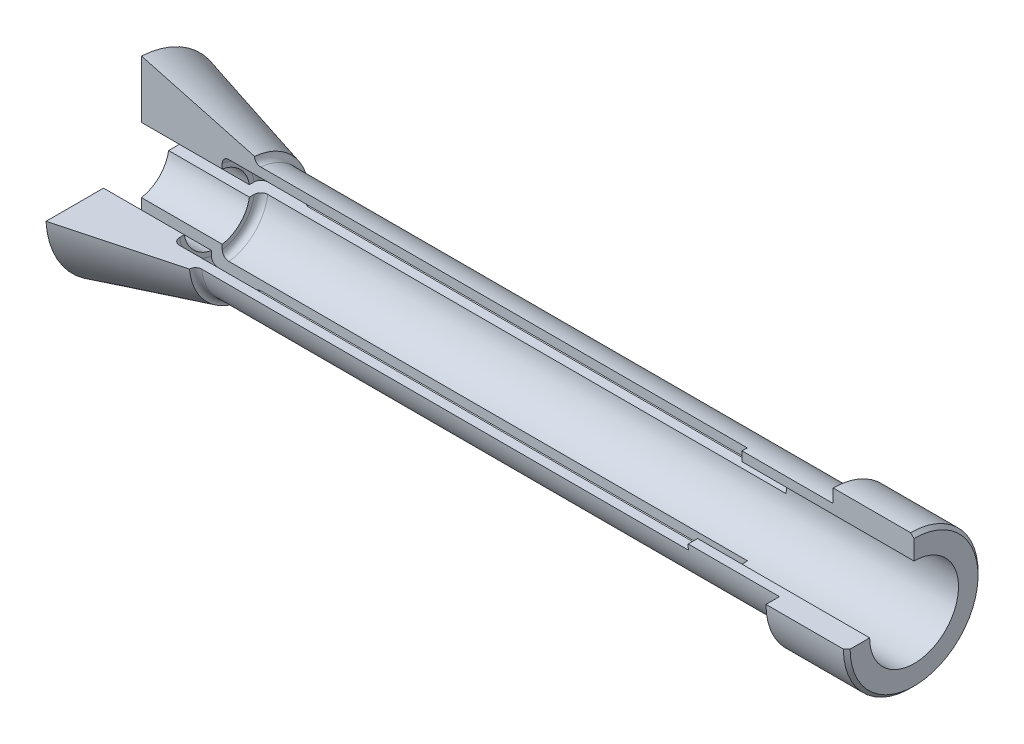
ISO-10303-21;
HEADER;
FILE_DESCRIPTION(('STEP AP214'),'2;1');
FILE_NAME('part.step','',(''),(''),'','','');
FILE_SCHEMA(('AUTOMOTIVE_DESIGN { 1 0 10303 214 1 1 1 1 }'));
ENDSEC;
DATA;
#1=APPLICATION_CONTEXT('core data for automotive mechanical design processes');
#2=APPLICATION_PROTOCOL_DEFINITION('international standard','automotive_design',2000,#1);
#3=PRODUCT_CONTEXT('',#1,'mechanical');
#4=PRODUCT('Part','Part','',(#3));
#5=PRODUCT_RELATED_PRODUCT_CATEGORY('part','',(#4));
#6=PRODUCT_DEFINITION_FORMATION('','',#4);
#7=PRODUCT_DEFINITION_CONTEXT('part definition',#1,'design');
#8=PRODUCT_DEFINITION('design','',#6,#7);
#9=PRODUCT_DEFINITION_SHAPE('','',#8);
#10=(LENGTH_UNIT() NAMED_UNIT(*) SI_UNIT(.MILLI.,.METRE.));
#11=(NAMED_UNIT(*) PLANE_ANGLE_UNIT() SI_UNIT($,.RADIAN.));
#12=(NAMED_UNIT(*) SI_UNIT($,.STERADIAN.) SOLID_ANGLE_UNIT());
#13=UNCERTAINTY_MEASURE_WITH_UNIT(LENGTH_MEASURE(1.E-05),#10,'distance_accuracy_value','');
#14=(GEOMETRIC_REPRESENTATION_CONTEXT(3) GLOBAL_UNCERTAINTY_ASSIGNED_CONTEXT((#13)) GLOBAL_UNIT_ASSIGNED_CONTEXT((#10,
#11,#12)) REPRESENTATION_CONTEXT('',''));
#15=CARTESIAN_POINT('',(0.,0.,0.));
#16=DIRECTION('',(0.,0.,1.));
#17=DIRECTION('',(1.,0.,0.));
#18=AXIS2_PLACEMENT_3D('',#15,#16,#17);
#19=CARTESIAN_POINT('',(-14.0873949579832,0.,0.));
#20=DIRECTION('',(-1.,0.,0.));
#21=DIRECTION('',(0.,0.,1.));
#22=AXIS2_PLACEMENT_3D('',#19,#20,#21);
#23=CYLINDRICAL_SURFACE('',#22,2.45);
#24=CARTESIAN_POINT('',(-3.,0.,0.));
#25=DIRECTION('',(-1.,0.,0.));
#26=DIRECTION('',(0.,0.,1.));
#27=AXIS2_PLACEMENT_3D('',#24,#25,#26);
#28=CIRCLE('',#27,2.45);
#29=CARTESIAN_POINT('',(-3.,-0.399999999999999,-2.41712639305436));
#30=VERTEX_POINT('',#29);
#31=CARTESIAN_POINT('',(-3.,-2.41712639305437,-0.399999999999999));
#32=VERTEX_POINT('',#31);
#33=EDGE_CURVE('E536',#30,#32,#28,.T.);
#34=ORIENTED_EDGE('',*,*,#33,.T.);
#35=DIRECTION('',(-1.,0.,0.));
#36=VECTOR('',#35,1.);
#37=CARTESIAN_POINT('',(42.,-2.41712639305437,-0.399999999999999));
#38=LINE('',#37,#36);
#39=CARTESIAN_POINT('',(3.00000000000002,-2.41712639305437,-0.399999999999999));
#40=VERTEX_POINT('',#39);
#41=EDGE_CURVE('E407',#40,#32,#38,.T.);
#42=ORIENTED_EDGE('',*,*,#41,.F.);
#43=CARTESIAN_POINT('',(3.,0.,0.));
#44=DIRECTION('',(-1.,0.,0.));
#45=DIRECTION('',(0.,0.,1.));
#46=AXIS2_PLACEMENT_3D('',#43,#44,#45);
#47=CIRCLE('',#46,2.45);
#48=CARTESIAN_POINT('',(3.00000000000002,-0.399999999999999,-2.41712639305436));
#49=VERTEX_POINT('',#48);
#50=EDGE_CURVE('E297',#49,#40,#47,.T.);
#51=ORIENTED_EDGE('',*,*,#50,.F.);
#52=DIRECTION('',(-1.,0.,0.));
#53=VECTOR('',#52,1.);
#54=CARTESIAN_POINT('',(42.,-0.399999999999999,-2.41712639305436));
#55=LINE('',#54,#53);
#56=EDGE_CURVE('E520',#49,#30,#55,.T.);
#57=ORIENTED_EDGE('',*,*,#56,.T.);
#58=EDGE_LOOP('',(#34,#42,#51,#57));
#59=FACE_BOUND('',#58,.T.);
#60=ADVANCED_FACE('F35',(#59),#23,.F.);
#61=CARTESIAN_POINT('',(3.,2.79999999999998,0.));
#62=DIRECTION('',(-1.,0.,0.));
#63=DIRECTION('',(0.,0.,1.));
#64=AXIS2_PLACEMENT_3D('',#61,#62,#63);
#65=PLANE('',#64);
#66=ORIENTED_EDGE('',*,*,#50,.T.);
#67=DIRECTION('',(0.,-1.,0.));
#68=VECTOR('',#67,1.);
#69=CARTESIAN_POINT('',(3.,2.79999999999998,-0.399999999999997));
#70=LINE('',#69,#68);
#71=CARTESIAN_POINT('',(2.99999999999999,-2.77128129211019,-0.399999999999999));
#72=VERTEX_POINT('',#71);
#73=EDGE_CURVE('E645',#40,#72,#70,.T.);
#74=ORIENTED_EDGE('',*,*,#73,.T.);
#75=CARTESIAN_POINT('',(3.,0.,0.));
#76=DIRECTION('',(-1.,0.,0.));
#77=DIRECTION('',(0.,0.,1.));
#78=AXIS2_PLACEMENT_3D('',#75,#76,#77);
#79=CIRCLE('',#78,2.79999999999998);
#80=CARTESIAN_POINT('',(3.,-0.4,-2.77128129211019));
#81=VERTEX_POINT('',#80);
#82=EDGE_CURVE('E292',#81,#72,#79,.T.);
#83=ORIENTED_EDGE('',*,*,#82,.F.);
#84=DIRECTION('',(0.,0.,1.));
#85=VECTOR('',#84,1.);
#86=CARTESIAN_POINT('',(3.,-0.400000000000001,0.));
#87=LINE('',#86,#85);
#88=EDGE_CURVE('E647',#81,#49,#87,.T.);
#89=ORIENTED_EDGE('',*,*,#88,.T.);
#90=EDGE_LOOP('',(#66,#74,#83,#89));
#91=FACE_BOUND('',#90,.T.);
#92=ADVANCED_FACE('F622',(#91),#65,.F.);
#93=CARTESIAN_POINT('',(3.5,0.,0.));
#94=DIRECTION('',(-1.,0.,0.));
#95=DIRECTION('',(0.,0.,1.));
#96=AXIS2_PLACEMENT_3D('',#93,#94,#95);
#97=TOROIDAL_SURFACE('',#96,2.79999999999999,0.5);
#98=ORIENTED_EDGE('',*,*,#82,.T.);
#99=CARTESIAN_POINT('',(3.16495170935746,-3.14580826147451,-0.399999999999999));
#100=CARTESIAN_POINT('',(3.18566442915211,-3.16465583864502,-0.399999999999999));
#101=CARTESIAN_POINT('',(3.20797546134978,-3.1817757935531,-0.399999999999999));
#102=CARTESIAN_POINT('',(3.2551704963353,-3.21204538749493,-0.399999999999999));
#103=CARTESIAN_POINT('',(3.28005733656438,-3.22519058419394,-0.399999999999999));
#104=CARTESIAN_POINT('',(3.33168422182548,-3.24710586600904,-0.399999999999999));
#105=CARTESIAN_POINT('',(3.35842381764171,-3.25587700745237,-0.399999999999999));
#106=CARTESIAN_POINT('',(3.41299214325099,-3.26878545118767,-0.399999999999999));
#107=CARTESIAN_POINT('',(3.44082061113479,-3.27292386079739,-0.399999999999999));
#108=CARTESIAN_POINT('',(3.496683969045,-3.27644261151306,-0.399999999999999));
#109=CARTESIAN_POINT('',(3.52471786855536,-3.27583868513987,-0.399999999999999));
#110=CARTESIAN_POINT('',(3.58028596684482,-3.26992777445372,-0.399999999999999));
#111=CARTESIAN_POINT('',(3.60782015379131,-3.26462067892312,-0.399999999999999));
#112=CARTESIAN_POINT('',(3.66158064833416,-3.2494670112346,-0.399999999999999));
#113=CARTESIAN_POINT('',(3.68780818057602,-3.23962478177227,-0.399999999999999));
#114=CARTESIAN_POINT('',(3.73824582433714,-3.21569028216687,-0.399999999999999));
#115=CARTESIAN_POINT('',(3.76245592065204,-3.20159797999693,-0.399999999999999));
#116=CARTESIAN_POINT('',(3.80825787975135,-3.16952085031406,-0.399999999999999));
#117=CARTESIAN_POINT('',(3.8298411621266,-3.15152377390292,-0.399999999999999));
#118=CARTESIAN_POINT('',(3.86970422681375,-3.11218309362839,-0.399999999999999));
#119=CARTESIAN_POINT('',(3.88798391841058,-3.09083939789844,-0.399999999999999));
#120=CARTESIAN_POINT('',(3.92085307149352,-3.04526293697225,-0.399999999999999));
#121=CARTESIAN_POINT('',(3.93541735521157,-3.02101201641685,-0.399999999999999));
#122=CARTESIAN_POINT('',(3.96030668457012,-2.97042482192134,-0.399999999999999));
#123=CARTESIAN_POINT('',(3.97063154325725,-2.94408845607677,-0.399999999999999));
#124=CARTESIAN_POINT('',(3.98684034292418,-2.88984215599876,-0.399999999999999));
#125=CARTESIAN_POINT('',(3.99268633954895,-2.86192088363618,-0.399999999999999));
#126=CARTESIAN_POINT('',(3.99964576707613,-2.80549460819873,-0.399999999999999));
#127=CARTESIAN_POINT('',(4.00075898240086,-2.77698957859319,-0.399999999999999));
#128=CARTESIAN_POINT('',(3.99822251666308,-2.71997940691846,-0.399999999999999));
#129=CARTESIAN_POINT('',(3.99453737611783,-2.69147583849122,-0.399999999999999));
#130=CARTESIAN_POINT('',(3.98244921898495,-2.63548663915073,-0.399999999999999));
#131=CARTESIAN_POINT('',(3.97404605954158,-2.60800103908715,-0.399999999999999));
#132=CARTESIAN_POINT('',(3.95272113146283,-2.55474791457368,-0.399999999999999));
#133=CARTESIAN_POINT('',(3.93978621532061,-2.52898565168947,-0.399999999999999));
#134=CARTESIAN_POINT('',(3.90975600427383,-2.48001094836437,-0.399999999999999));
#135=CARTESIAN_POINT('',(3.89266075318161,-2.45679848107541,-0.399999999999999));
#136=CARTESIAN_POINT('',(3.85486822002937,-2.41370798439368,-0.399999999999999));
#137=CARTESIAN_POINT('',(3.83418797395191,-2.39381502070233,-0.399999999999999));
#138=CARTESIAN_POINT('',(3.78974622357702,-2.35783364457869,-0.399999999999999));
#139=CARTESIAN_POINT('',(3.76598491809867,-2.3417449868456,-0.399999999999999));
#140=CARTESIAN_POINT('',(3.71635566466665,-2.31403945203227,-0.399999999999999));
#141=CARTESIAN_POINT('',(3.6905161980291,-2.30237156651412,-0.399999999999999));
#142=CARTESIAN_POINT('',(3.63722772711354,-2.28360685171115,-0.399999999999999));
#143=CARTESIAN_POINT('',(3.60977886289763,-2.2765096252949,-0.399999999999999));
#144=CARTESIAN_POINT('',(3.55444554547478,-2.26717742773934,-0.399999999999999));
#145=CARTESIAN_POINT('',(3.52657184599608,-2.26487862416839,-0.399999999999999));
#146=CARTESIAN_POINT('',(3.47083767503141,-2.26502544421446,-0.399999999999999));
#147=CARTESIAN_POINT('',(3.44297720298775,-2.26747084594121,-0.399999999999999));
#148=CARTESIAN_POINT('',(3.38823835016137,-2.2769981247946,-0.399999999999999));
#149=CARTESIAN_POINT('',(3.36135499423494,-2.28405147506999,-0.399999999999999));
#150=CARTESIAN_POINT('',(3.30914419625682,-2.30254747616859,-0.399999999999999));
#151=CARTESIAN_POINT('',(3.28381678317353,-2.31399020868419,-0.399999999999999));
#152=CARTESIAN_POINT('',(3.23528086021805,-2.34099230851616,-0.399999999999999));
#153=CARTESIAN_POINT('',(3.21208464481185,-2.35657376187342,-0.399999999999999));
#154=CARTESIAN_POINT('',(3.16859360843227,-2.39136293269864,-0.399999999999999));
#155=CARTESIAN_POINT('',(3.14829898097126,-2.41057089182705,-0.399999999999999));
#156=CARTESIAN_POINT('',(3.11090474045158,-2.45233426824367,-0.399999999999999));
#157=CARTESIAN_POINT('',(3.0938501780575,-2.47493002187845,-0.399999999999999));
#158=CARTESIAN_POINT('',(3.06372149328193,-2.52263540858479,-0.399999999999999));
#159=CARTESIAN_POINT('',(3.05064765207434,-2.54774521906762,-0.399999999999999));
#160=CARTESIAN_POINT('',(3.02869140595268,-2.6001003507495,-0.399999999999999));
#161=CARTESIAN_POINT('',(3.01986261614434,-2.62736816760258,-0.399999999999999));
#162=CARTESIAN_POINT('',(3.00687972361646,-2.68299417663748,-0.399999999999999));
#163=CARTESIAN_POINT('',(3.00272562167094,-2.71135236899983,-0.399999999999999));
#164=CARTESIAN_POINT('',(2.99920067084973,-2.76852049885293,-0.399999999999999));
#165=CARTESIAN_POINT('',(2.99985600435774,-2.79733205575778,-0.399999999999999));
#166=CARTESIAN_POINT('',(3.0060054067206,-2.85444256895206,-0.399999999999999));
#167=CARTESIAN_POINT('',(3.01150065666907,-2.88274139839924,-0.399999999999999));
#168=CARTESIAN_POINT('',(3.02717488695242,-2.93795798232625,-0.399999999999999));
#169=CARTESIAN_POINT('',(3.03734607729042,-2.96487795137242,-0.399999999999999));
#170=CARTESIAN_POINT('',(3.06209065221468,-3.01658553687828,-0.399999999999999));
#171=CARTESIAN_POINT('',(3.07665859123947,-3.04137574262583,-0.399999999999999));
#172=CARTESIAN_POINT('',(3.10366616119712,-3.07948918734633,-0.399999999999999));
#173=CARTESIAN_POINT('',(3.11491314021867,-3.09367269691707,-0.399999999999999));
#174=CARTESIAN_POINT('',(3.13886850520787,-3.12074700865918,-0.399999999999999));
#175=CARTESIAN_POINT('',(3.15157688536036,-3.13363781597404,-0.399999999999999));
#176=CARTESIAN_POINT('',(3.16495170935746,-3.14580826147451,-0.399999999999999));
#177=B_SPLINE_CURVE_WITH_KNOTS('',3,(#99,#100,#101,#102,#103,#104,#105,#106,#107,#108,#109,#110,
#111,#112,#113,#114,#115,#116,#117,#118,#119,#120,#121,#122,#123,#124,#125,#126,#127,#128,#129,
#130,#131,#132,#133,#134,#135,#136,#137,#138,#139,#140,#141,#142,#143,#144,#145,#146,#147,#148,
#149,#150,#151,#152,#153,#154,#155,#156,#157,#158,#159,#160,#161,#162,#163,#164,#165,#166,#167,
#168,#169,#170,#171,#172,#173,#174,#175,#176),.UNSPECIFIED.,.T.,.F.,(4,2,2,2,2,2,2,2,2,2,2,2,2,
2,2,2,2,2,2,2,2,2,2,2,2,2,2,2,2,2,2,2,2,2,2,2,2,2,4),(0.,0.0839477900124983,0.167989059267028,
0.252010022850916,0.336010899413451,0.419733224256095,0.503457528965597,0.587101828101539,
0.670746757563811,0.754657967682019,0.838571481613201,0.923039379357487,1.00751100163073,
1.09269057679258,1.17787403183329,1.26369057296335,1.3495097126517,1.435579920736,
1.52164922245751,1.60732020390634,1.6929856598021,1.77763017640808,1.86226733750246,
1.94577121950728,2.02927119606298,2.11225907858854,2.19524850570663,2.27869002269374,
2.36213710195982,2.44667091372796,2.53121069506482,2.616791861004,2.7023730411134,
2.78842046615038,2.87448889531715,2.96041445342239,3.04623402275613,3.10044184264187,
3.15464944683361),.UNSPECIFIED.);
#178=CARTESIAN_POINT('',(3.50000000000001,-3.27566787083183,-0.399999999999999));
#179=VERTEX_POINT('',#178);
#180=EDGE_CURVE('E734',#72,#179,#177,.T.);
#181=ORIENTED_EDGE('',*,*,#180,.T.);
#182=CARTESIAN_POINT('',(3.50000000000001,0.,0.));
#183=DIRECTION('',(-1.,0.,0.));
#184=DIRECTION('',(0.,0.,1.));
#185=AXIS2_PLACEMENT_3D('',#182,#183,#184);
#186=CIRCLE('',#185,3.29999999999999);
#187=CARTESIAN_POINT('',(3.50000000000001,-0.4,-3.27566787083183));
#188=VERTEX_POINT('',#187);
#189=EDGE_CURVE('E278',#188,#179,#186,.T.);
#190=ORIENTED_EDGE('',*,*,#189,.F.);
#191=CARTESIAN_POINT('',(3.16495170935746,-0.4,-3.14580826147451));
#192=CARTESIAN_POINT('',(3.14400660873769,-0.4,-3.12674579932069));
#193=CARTESIAN_POINT('',(3.12466567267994,-0.4,-3.10588842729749));
#194=CARTESIAN_POINT('',(3.08975317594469,-0.4,-3.06119832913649));
#195=CARTESIAN_POINT('',(3.07418654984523,-0.4,-3.03736176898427));
#196=CARTESIAN_POINT('',(3.0472793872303,-0.4,-2.98743620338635));
#197=CARTESIAN_POINT('',(3.03593530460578,-0.4,-2.9613491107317));
#198=CARTESIAN_POINT('',(3.01776081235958,-0.4,-2.90765657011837));
#199=CARTESIAN_POINT('',(3.01092928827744,-0.4,-2.8800514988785));
#200=CARTESIAN_POINT('',(3.0019202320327,-0.4,-2.8239138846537));
#201=CARTESIAN_POINT('',(2.99977223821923,-0.4,-2.79537660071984));
#202=CARTESIAN_POINT('',(3.00026607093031,-0.4,-2.7383420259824));
#203=CARTESIAN_POINT('',(3.00290829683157,-0.4,-2.70984473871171));
#204=CARTESIAN_POINT('',(3.01293526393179,-0.4,-2.6535170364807));
#205=CARTESIAN_POINT('',(3.020348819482,-0.4,-2.62569174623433));
#206=CARTESIAN_POINT('',(3.03974036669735,-0.4,-2.57167902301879));
#207=CARTESIAN_POINT('',(3.05171842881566,-0.4,-2.5454916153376));
#208=CARTESIAN_POINT('',(3.07991528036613,-0.4,-2.4955001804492));
#209=CARTESIAN_POINT('',(3.09613499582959,-0.4,-2.47169667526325));
#210=CARTESIAN_POINT('',(3.13236948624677,-0.4,-2.42717721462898));
#211=CARTESIAN_POINT('',(3.15238413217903,-0.4,-2.40646115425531));
#212=CARTESIAN_POINT('',(3.19548178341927,-0.4,-2.36888804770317));
#213=CARTESIAN_POINT('',(3.2185396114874,-0.4,-2.35200213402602));
#214=CARTESIAN_POINT('',(3.26719443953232,-0.4,-2.32240327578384));
#215=CARTESIAN_POINT('',(3.29279123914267,-0.4,-2.30969000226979));
#216=CARTESIAN_POINT('',(3.34542798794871,-0.4,-2.2889800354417));
#217=CARTESIAN_POINT('',(3.37244382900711,-0.4,-2.28092206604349));
#218=CARTESIAN_POINT('',(3.4274516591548,-0.4,-2.26951562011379));
#219=CARTESIAN_POINT('',(3.45544357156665,-0.4,-2.26616677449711));
#220=CARTESIAN_POINT('',(3.51126428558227,-0.4,-2.26429674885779));
#221=CARTESIAN_POINT('',(3.53909125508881,-0.4,-2.26572043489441));
#222=CARTESIAN_POINT('',(3.5941082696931,-0.4,-2.27322860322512));
#223=CARTESIAN_POINT('',(3.62129832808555,-0.4,-2.27931298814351));
#224=CARTESIAN_POINT('',(3.67422937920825,-0.4,-2.29593789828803));
#225=CARTESIAN_POINT('',(3.69997267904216,-0.4,-2.30647108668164));
#226=CARTESIAN_POINT('',(3.74934861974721,-0.4,-2.33167118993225));
#227=CARTESIAN_POINT('',(3.77298117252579,-0.4,-2.34633827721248));
#228=CARTESIAN_POINT('',(3.81770590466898,-0.4,-2.37952675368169));
#229=CARTESIAN_POINT('',(3.83877244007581,-0.4,-2.39808268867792));
#230=CARTESIAN_POINT('',(3.8775439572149,-0.4,-2.43842471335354));
#231=CARTESIAN_POINT('',(3.8952486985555,-0.4,-2.46021103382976));
#232=CARTESIAN_POINT('',(3.92704879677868,-0.4,-2.50671736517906));
#233=CARTESIAN_POINT('',(3.94109127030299,-0.4,-2.53147354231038));
#234=CARTESIAN_POINT('',(3.96486926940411,-0.4,-2.58297457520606));
#235=CARTESIAN_POINT('',(3.97460453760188,-0.4,-2.6097195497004));
#236=CARTESIAN_POINT('',(3.98958205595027,-0.4,-2.66473061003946));
#237=CARTESIAN_POINT('',(3.99477795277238,-0.4,-2.6930093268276));
#238=CARTESIAN_POINT('',(4.00036145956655,-0.4,-2.75003805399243));
#239=CARTESIAN_POINT('',(4.00074895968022,-0.4,-2.77878807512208));
#240=CARTESIAN_POINT('',(3.99669100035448,-0.4,-2.83601502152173));
#241=CARTESIAN_POINT('',(3.99223399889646,-0.4,-2.86449113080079));
#242=CARTESIAN_POINT('',(3.97858067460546,-0.4,-2.92028415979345));
#243=CARTESIAN_POINT('',(3.96938443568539,-0.4,-2.94760110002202));
#244=CARTESIAN_POINT('',(3.94655071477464,-0.4,-3.00016466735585));
#245=CARTESIAN_POINT('',(3.93293351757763,-0.4,-3.02542010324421));
#246=CARTESIAN_POINT('',(3.90161934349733,-0.4,-3.07326120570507));
#247=CARTESIAN_POINT('',(3.88392252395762,-0.4,-3.09584697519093));
#248=CARTESIAN_POINT('',(3.84510379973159,-0.4,-3.13751170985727));
#249=CARTESIAN_POINT('',(3.82401073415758,-0.4,-3.15661754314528));
#250=CARTESIAN_POINT('',(3.77889372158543,-0.4,-3.19098170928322));
#251=CARTESIAN_POINT('',(3.75486990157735,-0.4,-3.20624020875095));
#252=CARTESIAN_POINT('',(3.70478389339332,-0.4,-3.23234802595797));
#253=CARTESIAN_POINT('',(3.67873983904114,-0.4,-3.24323213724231));
#254=CARTESIAN_POINT('',(3.62518858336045,-0.4,-3.26044451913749));
#255=CARTESIAN_POINT('',(3.59768149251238,-0.4,-3.26677313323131));
#256=CARTESIAN_POINT('',(3.54215542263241,-0.4,-3.2746640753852));
#257=CARTESIAN_POINT('',(3.51414033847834,-0.4,-3.2762538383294));
#258=CARTESIAN_POINT('',(3.45823455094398,-0.4,-3.27469742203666));
#259=CARTESIAN_POINT('',(3.4303438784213,-0.4,-3.27155012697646));
#260=CARTESIAN_POINT('',(3.37553053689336,-0.4,-3.26062057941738));
#261=CARTESIAN_POINT('',(3.34860655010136,-0.4,-3.25284491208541));
#262=CARTESIAN_POINT('',(3.2964664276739,-0.4,-3.23289635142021));
#263=CARTESIAN_POINT('',(3.27124825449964,-0.4,-3.22072881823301));
#264=CARTESIAN_POINT('',(3.23252966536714,-0.4,-3.19787019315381));
#265=CARTESIAN_POINT('',(3.2182739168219,-0.4,-3.18843262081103));
#266=CARTESIAN_POINT('',(3.19080148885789,-0.4,-3.16815044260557));
#267=CARTESIAN_POINT('',(3.17758480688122,-0.4,-3.15730584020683));
#268=CARTESIAN_POINT('',(3.16495170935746,-0.4,-3.14580826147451));
#269=B_SPLINE_CURVE_WITH_KNOTS('',3,(#191,#192,#193,#194,#195,#196,#197,#198,#199,#200,#201,
#202,#203,#204,#205,#206,#207,#208,#209,#210,#211,#212,#213,#214,#215,#216,#217,#218,#219,#220,
#221,#222,#223,#224,#225,#226,#227,#228,#229,#230,#231,#232,#233,#234,#235,#236,#237,#238,#239,
#240,#241,#242,#243,#244,#245,#246,#247,#248,#249,#250,#251,#252,#253,#254,#255,#256,#257,#258,
#259,#260,#261,#262,#263,#264,#265,#266,#267,#268),.UNSPECIFIED.,.T.,.F.,(4,2,2,2,2,2,2,2,2,2,2,
2,2,2,2,2,2,2,2,2,2,2,2,2,2,2,2,2,2,2,2,2,2,2,2,2,2,2,4),(0.,0.0848997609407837,
0.169909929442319,0.25484854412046,0.339766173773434,0.425217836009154,0.510676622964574,
0.596656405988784,0.682637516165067,0.768637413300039,0.854634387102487,0.939959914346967,
1.02527871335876,1.10944728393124,1.19360925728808,1.27680232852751,1.35999366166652,
1.44304833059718,1.52610646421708,1.60993632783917,1.69377218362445,1.77875887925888,
1.86375065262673,1.94960049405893,2.03545229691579,2.12150909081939,2.20756436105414,
2.29323023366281,2.37889280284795,2.46386300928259,2.5488295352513,2.63310619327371,
2.7173764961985,2.80115797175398,2.88495918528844,2.96864145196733,3.05222193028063,
3.10342959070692,3.15463712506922),.UNSPECIFIED.);
#270=EDGE_CURVE('E464',#188,#81,#269,.T.);
#271=ORIENTED_EDGE('',*,*,#270,.T.);
#272=EDGE_LOOP('',(#98,#181,#190,#271));
#273=FACE_BOUND('',#272,.T.);
#274=ADVANCED_FACE('F442',(#273),#97,.F.);
#275=CARTESIAN_POINT('',(5.84922678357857,0.,0.));
#276=DIRECTION('',(-1.,0.,0.));
#277=DIRECTION('',(0.,0.,1.));
#278=AXIS2_PLACEMENT_3D('',#275,#276,#277);
#279=TOROIDAL_SURFACE('',#278,4.44922678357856,0.449226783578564);
#280=CARTESIAN_POINT('',(5.84922678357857,0.,0.));
#281=DIRECTION('',(-1.,0.,0.));
#282=DIRECTION('',(0.,0.,1.));
#283=AXIS2_PLACEMENT_3D('',#280,#281,#282);
#284=CIRCLE('',#283,4.);
#285=CARTESIAN_POINT('',(5.84922678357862,-0.4,-3.9799497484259));
#286=VERTEX_POINT('',#285);
#287=CARTESIAN_POINT('',(5.84922678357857,-3.97994974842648,-0.399999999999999));
#288=VERTEX_POINT('',#287);
#289=EDGE_CURVE('E565',#286,#288,#284,.T.);
#290=ORIENTED_EDGE('',*,*,#289,.T.);
#291=CARTESIAN_POINT('',(5.42156822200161,-4.29310850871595,-0.399999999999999));
#292=CARTESIAN_POINT('',(5.4138134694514,-4.31733158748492,-0.399999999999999));
#293=CARTESIAN_POINT('',(5.40809904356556,-4.34222751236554,-0.399999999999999));
#294=CARTESIAN_POINT('',(5.40092527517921,-4.39264643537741,-0.399999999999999));
#295=CARTESIAN_POINT('',(5.39947115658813,-4.41817016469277,-0.399999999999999));
#296=CARTESIAN_POINT('',(5.40086955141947,-4.46909020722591,-0.399999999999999));
#297=CARTESIAN_POINT('',(5.40372008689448,-4.49448657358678,-0.399999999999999));
#298=CARTESIAN_POINT('',(5.41364688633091,-4.5444324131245,-0.399999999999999));
#299=CARTESIAN_POINT('',(5.42072206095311,-4.56898210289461,-0.399999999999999));
#300=CARTESIAN_POINT('',(5.43889544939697,-4.61652720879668,-0.399999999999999));
#301=CARTESIAN_POINT('',(5.44999115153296,-4.63952358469,-0.399999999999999));
#302=CARTESIAN_POINT('',(5.47589708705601,-4.68332061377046,-0.399999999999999));
#303=CARTESIAN_POINT('',(5.49070742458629,-4.70412120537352,-0.399999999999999));
#304=CARTESIAN_POINT('',(5.52357694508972,-4.74286948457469,-0.399999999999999));
#305=CARTESIAN_POINT('',(5.54162654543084,-4.76082530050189,-0.399999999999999));
#306=CARTESIAN_POINT('',(5.58049341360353,-4.79343866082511,-0.399999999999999));
#307=CARTESIAN_POINT('',(5.60131062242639,-4.80809627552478,-0.399999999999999));
#308=CARTESIAN_POINT('',(5.64504284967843,-4.83364280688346,-0.399999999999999));
#309=CARTESIAN_POINT('',(5.66795020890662,-4.84454483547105,-0.399999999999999));
#310=CARTESIAN_POINT('',(5.71527357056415,-4.8623358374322,-0.399999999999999));
#311=CARTESIAN_POINT('',(5.73968954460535,-4.86922488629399,-0.399999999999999));
#312=CARTESIAN_POINT('',(5.78926291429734,-4.87877630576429,-0.399999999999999));
#313=CARTESIAN_POINT('',(5.81441801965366,-4.88145056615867,-0.399999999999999));
#314=CARTESIAN_POINT('',(5.86481972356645,-4.88253236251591,-0.399999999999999));
#315=CARTESIAN_POINT('',(5.89006632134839,-4.88093993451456,-0.399999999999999));
#316=CARTESIAN_POINT('',(5.9399027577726,-4.87353900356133,-0.399999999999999));
#317=CARTESIAN_POINT('',(5.9644933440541,-4.86773553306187,-0.399999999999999));
#318=CARTESIAN_POINT('',(6.0123522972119,-4.85208573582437,-0.399999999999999));
#319=CARTESIAN_POINT('',(6.03562066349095,-4.84223940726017,-0.399999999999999));
#320=CARTESIAN_POINT('',(6.08019611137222,-4.81877773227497,-0.399999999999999));
#321=CARTESIAN_POINT('',(6.10150160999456,-4.80515937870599,-0.399999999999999));
#322=CARTESIAN_POINT('',(6.14153131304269,-4.77454756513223,-0.399999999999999));
#323=CARTESIAN_POINT('',(6.160255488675,-4.75755406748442,-0.399999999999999));
#324=CARTESIAN_POINT('',(6.19464331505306,-4.72062938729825,-0.399999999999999));
#325=CARTESIAN_POINT('',(6.21029905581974,-4.70069083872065,-0.399999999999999));
#326=CARTESIAN_POINT('',(6.23805459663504,-4.65847594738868,-0.399999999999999));
#327=CARTESIAN_POINT('',(6.25015433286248,-4.63619956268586,-0.399999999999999));
#328=CARTESIAN_POINT('',(6.27049907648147,-4.58985860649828,-0.399999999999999));
#329=CARTESIAN_POINT('',(6.27873054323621,-4.56578809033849,-0.399999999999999));
#330=CARTESIAN_POINT('',(6.29104975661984,-4.51660906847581,-0.399999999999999));
#331=CARTESIAN_POINT('',(6.29513742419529,-4.49150054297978,-0.399999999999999));
#332=CARTESIAN_POINT('',(6.29906407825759,-4.44087375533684,-0.399999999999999));
#333=CARTESIAN_POINT('',(6.29888965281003,-4.41535445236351,-0.399999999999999));
#334=CARTESIAN_POINT('',(6.29426563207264,-4.36470598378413,-0.399999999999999));
#335=CARTESIAN_POINT('',(6.28981598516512,-4.33957682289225,-0.399999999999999));
#336=CARTESIAN_POINT('',(6.27675667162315,-4.29038499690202,-0.399999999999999));
#337=CARTESIAN_POINT('',(6.26814107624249,-4.26632390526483,-0.399999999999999));
#338=CARTESIAN_POINT('',(6.24698784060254,-4.21999203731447,-0.399999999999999));
#339=CARTESIAN_POINT('',(6.23445020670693,-4.19772125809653,-0.399999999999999));
#340=CARTESIAN_POINT('',(6.20582177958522,-4.15563483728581,-0.399999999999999));
#341=CARTESIAN_POINT('',(6.18973545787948,-4.13581615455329,-0.399999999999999));
#342=CARTESIAN_POINT('',(6.1544524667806,-4.09917339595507,-0.399999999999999));
#343=CARTESIAN_POINT('',(6.135255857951,-4.08234926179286,-0.399999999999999));
#344=CARTESIAN_POINT('',(6.09437316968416,-4.05224264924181,-0.399999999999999));
#345=CARTESIAN_POINT('',(6.07269672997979,-4.03894708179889,-0.399999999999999));
#346=CARTESIAN_POINT('',(6.02741137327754,-4.01620348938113,-0.399999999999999));
#347=CARTESIAN_POINT('',(6.00380250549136,-4.00675536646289,-0.399999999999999));
#348=CARTESIAN_POINT('',(5.95543994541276,-3.99201956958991,-0.399999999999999));
#349=CARTESIAN_POINT('',(5.93069206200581,-3.9867128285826,-0.399999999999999));
#350=CARTESIAN_POINT('',(5.88065612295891,-3.98034358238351,-0.399999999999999));
#351=CARTESIAN_POINT('',(5.85536807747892,-3.9792809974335,-0.399999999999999));
#352=CARTESIAN_POINT('',(5.80505069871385,-3.98142798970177,-0.399999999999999));
#353=CARTESIAN_POINT('',(5.7800208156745,-3.98462471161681,-0.399999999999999));
#354=CARTESIAN_POINT('',(5.73085392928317,-3.99517376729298,-0.399999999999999));
#355=CARTESIAN_POINT('',(5.70671688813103,-4.0025259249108,-0.399999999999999));
#356=CARTESIAN_POINT('',(5.66001163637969,-4.02117297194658,-0.399999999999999));
#357=CARTESIAN_POINT('',(5.63744376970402,-4.03246872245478,-0.399999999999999));
#358=CARTESIAN_POINT('',(5.59450995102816,-4.05867963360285,-0.399999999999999));
#359=CARTESIAN_POINT('',(5.5741445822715,-4.07359574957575,-0.399999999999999));
#360=CARTESIAN_POINT('',(5.5361154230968,-4.10668063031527,-0.399999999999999));
#361=CARTESIAN_POINT('',(5.51846260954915,-4.12486199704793,-0.399999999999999));
#362=CARTESIAN_POINT('',(5.486460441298,-4.16390541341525,-0.399999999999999));
#363=CARTESIAN_POINT('',(5.47210723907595,-4.18476429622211,-0.399999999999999));
#364=CARTESIAN_POINT('',(5.45177357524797,-4.2203530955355,-0.399999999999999));
#365=CARTESIAN_POINT('',(5.44467021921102,-4.23445421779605,-0.399999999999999));
#366=CARTESIAN_POINT('',(5.43197236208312,-4.26332012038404,-0.399999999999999));
#367=CARTESIAN_POINT('',(5.42637786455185,-4.27808490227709,-0.399999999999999));
#368=CARTESIAN_POINT('',(5.42156822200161,-4.29310850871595,-0.399999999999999));
#369=B_SPLINE_CURVE_WITH_KNOTS('',3,(#291,#292,#293,#294,#295,#296,#297,#298,#299,#300,#301,
#302,#303,#304,#305,#306,#307,#308,#309,#310,#311,#312,#313,#314,#315,#316,#317,#318,#319,#320,
#321,#322,#323,#324,#325,#326,#327,#328,#329,#330,#331,#332,#333,#334,#335,#336,#337,#338,#339,
#340,#341,#342,#343,#344,#345,#346,#347,#348,#349,#350,#351,#352,#353,#354,#355,#356,#357,#358,
#359,#360,#361,#362,#363,#364,#365,#366,#367,#368),.UNSPECIFIED.,.T.,.F.,(4,2,2,2,2,2,2,2,2,2,2,
2,2,2,2,2,2,2,2,2,2,2,2,2,2,2,2,2,2,2,2,2,2,2,2,2,2,2,4),(0.,0.0762447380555,0.15258292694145,
0.228886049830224,0.305169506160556,0.3814053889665,0.457643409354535,0.533659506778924,
0.609673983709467,0.685420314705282,0.761165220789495,0.836696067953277,0.912226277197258,
0.987666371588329,1.06310650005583,1.13860694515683,1.21410823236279,1.28980166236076,
1.36549645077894,1.44145426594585,1.51741353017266,1.59361185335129,1.66981109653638,
1.74611910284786,1.82242698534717,1.89863925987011,1.97485005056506,2.05077405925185,
2.12669613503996,2.2022665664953,2.27783557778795,2.35317702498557,2.42851527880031,
2.50386999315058,2.57924461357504,2.65491664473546,2.73049998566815,2.77778828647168,
2.82507669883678),.UNSPECIFIED.);
#370=CARTESIAN_POINT('',(5.4,-4.4312096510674,-0.399999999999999));
#371=VERTEX_POINT('',#370);
#372=EDGE_CURVE('E669',#288,#371,#369,.T.);
#373=ORIENTED_EDGE('',*,*,#372,.T.);
#374=CARTESIAN_POINT('',(5.4,0.,0.));
#375=DIRECTION('',(-1.,0.,0.));
#376=DIRECTION('',(0.,0.,1.));
#377=AXIS2_PLACEMENT_3D('',#374,#375,#376);
#378=CIRCLE('',#377,4.44922678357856);
#379=CARTESIAN_POINT('',(5.4,-0.4,-4.4312096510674));
#380=VERTEX_POINT('',#379);
#381=EDGE_CURVE('E563',#380,#371,#378,.T.);
#382=ORIENTED_EDGE('',*,*,#381,.F.);
#383=CARTESIAN_POINT('',(5.42156822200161,-0.4,-4.29310850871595));
#384=CARTESIAN_POINT('',(5.42930475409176,-0.4,-4.26894960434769));
#385=CARTESIAN_POINT('',(5.43908207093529,-0.4,-4.24542508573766));
#386=CARTESIAN_POINT('',(5.4624517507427,-0.4,-4.20032938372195));
#387=CARTESIAN_POINT('',(5.47604861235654,-0.4,-4.17876054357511));
#388=CARTESIAN_POINT('',(5.50667086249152,-0.4,-4.1382190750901));
#389=CARTESIAN_POINT('',(5.52369516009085,-0.4,-4.11924562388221));
#390=CARTESIAN_POINT('',(5.5606918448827,-0.4,-4.08444198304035));
#391=CARTESIAN_POINT('',(5.58066347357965,-0.4,-4.06861098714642));
#392=CARTESIAN_POINT('',(5.62293157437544,-0.4,-4.04058753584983));
#393=CARTESIAN_POINT('',(5.64522116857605,-0.4,-4.02838470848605));
#394=CARTESIAN_POINT('',(5.69154038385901,-0.4,-4.00791368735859));
#395=CARTESIAN_POINT('',(5.71557002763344,-0.4,-3.99964554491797));
#396=CARTESIAN_POINT('',(5.76456851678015,-0.4,-3.98731682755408));
#397=CARTESIAN_POINT('',(5.78953256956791,-0.4,-3.98323720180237));
#398=CARTESIAN_POINT('',(5.83979093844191,-0.4,-3.97933920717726));
#399=CARTESIAN_POINT('',(5.86508524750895,-0.4,-3.97952074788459));
#400=CARTESIAN_POINT('',(5.91521632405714,-0.4,-3.98413345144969));
#401=CARTESIAN_POINT('',(5.94005411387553,-0.4,-3.98855351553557));
#402=CARTESIAN_POINT('',(5.98863594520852,-0.4,-4.0014974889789));
#403=CARTESIAN_POINT('',(6.01237998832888,-0.4,-4.01002139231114));
#404=CARTESIAN_POINT('',(6.05812429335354,-0.4,-4.03093375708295));
#405=CARTESIAN_POINT('',(6.08012306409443,-0.4,-4.04332547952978));
#406=CARTESIAN_POINT('',(6.12173843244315,-0.4,-4.07161308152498));
#407=CARTESIAN_POINT('',(6.14135498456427,-0.4,-4.08750902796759));
#408=CARTESIAN_POINT('',(6.17772987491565,-0.4,-4.1224167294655));
#409=CARTESIAN_POINT('',(6.19447710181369,-0.4,-4.14144006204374));
#410=CARTESIAN_POINT('',(6.22455774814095,-0.4,-4.18201731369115));
#411=CARTESIAN_POINT('',(6.23789108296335,-0.4,-4.20357129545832));
#412=CARTESIAN_POINT('',(6.26082888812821,-0.4,-4.2487046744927));
#413=CARTESIAN_POINT('',(6.27041594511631,-0.4,-4.27229292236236));
#414=CARTESIAN_POINT('',(6.28550784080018,-0.4,-4.32074113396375));
#415=CARTESIAN_POINT('',(6.29101259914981,-0.4,-4.34560112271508));
#416=CARTESIAN_POINT('',(6.29779716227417,-0.4,-4.39596982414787));
#417=CARTESIAN_POINT('',(6.29906382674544,-0.4,-4.42148030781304));
#418=CARTESIAN_POINT('',(6.29729840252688,-0.4,-4.47235228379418));
#419=CARTESIAN_POINT('',(6.294266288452,-0.4,-4.49771377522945));
#420=CARTESIAN_POINT('',(6.28398356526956,-0.4,-4.5475775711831));
#421=CARTESIAN_POINT('',(6.27673126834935,-0.4,-4.57207952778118));
#422=CARTESIAN_POINT('',(6.25820761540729,-0.4,-4.61951419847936));
#423=CARTESIAN_POINT('',(6.24693629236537,-0.4,-4.64244692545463));
#424=CARTESIAN_POINT('',(6.22071736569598,-0.4,-4.6860396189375));
#425=CARTESIAN_POINT('',(6.20577746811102,-0.4,-4.70670421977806));
#426=CARTESIAN_POINT('',(6.17262946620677,-0.4,-4.74522097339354));
#427=CARTESIAN_POINT('',(6.15442141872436,-0.4,-4.76307317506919));
#428=CARTESIAN_POINT('',(6.11532017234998,-0.4,-4.79539327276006));
#429=CARTESIAN_POINT('',(6.09443632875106,-0.4,-4.80987248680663));
#430=CARTESIAN_POINT('',(6.05052773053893,-0.4,-4.83510561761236));
#431=CARTESIAN_POINT('',(6.02750301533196,-0.4,-4.84585960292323));
#432=CARTESIAN_POINT('',(5.98004836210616,-0.4,-4.86330087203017));
#433=CARTESIAN_POINT('',(5.9556233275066,-0.4,-4.87000149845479));
#434=CARTESIAN_POINT('',(5.90599414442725,-0.4,-4.87919756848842));
#435=CARTESIAN_POINT('',(5.88079000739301,-0.4,-4.88169307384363));
#436=CARTESIAN_POINT('',(5.83037338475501,-0.4,-4.8824058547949));
#437=CARTESIAN_POINT('',(5.80516102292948,-0.4,-4.88063191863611));
#438=CARTESIAN_POINT('',(5.75539230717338,-0.4,-4.87287553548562));
#439=CARTESIAN_POINT('',(5.73083595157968,-0.4,-4.86689309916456));
#440=CARTESIAN_POINT('',(5.68307941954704,-0.4,-4.85089379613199));
#441=CARTESIAN_POINT('',(5.65987902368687,-0.4,-4.84087758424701));
#442=CARTESIAN_POINT('',(5.61548498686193,-0.4,-4.81709893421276));
#443=CARTESIAN_POINT('',(5.59429136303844,-0.4,-4.80333646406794));
#444=CARTESIAN_POINT('',(5.55447026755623,-0.4,-4.77243156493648));
#445=CARTESIAN_POINT('',(5.53584747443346,-0.4,-4.75528310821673));
#446=CARTESIAN_POINT('',(5.50173486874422,-0.4,-4.7181125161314));
#447=CARTESIAN_POINT('',(5.48624498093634,-0.4,-4.69809044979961));
#448=CARTESIAN_POINT('',(5.45878527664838,-0.4,-4.65567569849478));
#449=CARTESIAN_POINT('',(5.44682637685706,-0.4,-4.63327594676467));
#450=CARTESIAN_POINT('',(5.4268211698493,-0.4,-4.58678546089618));
#451=CARTESIAN_POINT('',(5.41877590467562,-0.4,-4.5626942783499));
#452=CARTESIAN_POINT('',(5.40679889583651,-0.4,-4.51341154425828));
#453=CARTESIAN_POINT('',(5.40288354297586,-0.4,-4.48821601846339));
#454=CARTESIAN_POINT('',(5.39933415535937,-0.4,-4.43754587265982));
#455=CARTESIAN_POINT('',(5.39969509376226,-0.4,-4.4120716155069));
#456=CARTESIAN_POINT('',(5.40374583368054,-0.4,-4.37091686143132));
#457=CARTESIAN_POINT('',(5.40615485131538,-0.4,-4.35509932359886));
#458=CARTESIAN_POINT('',(5.41262854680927,-0.4,-4.32380673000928));
#459=CARTESIAN_POINT('',(5.41669322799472,-0.4,-4.30833167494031));
#460=CARTESIAN_POINT('',(5.42156822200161,-0.4,-4.29310850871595));
#461=B_SPLINE_CURVE_WITH_KNOTS('',3,(#383,#384,#385,#386,#387,#388,#389,#390,#391,#392,#393,
#394,#395,#396,#397,#398,#399,#400,#401,#402,#403,#404,#405,#406,#407,#408,#409,#410,#411,#412,
#413,#414,#415,#416,#417,#418,#419,#420,#421,#422,#423,#424,#425,#426,#427,#428,#429,#430,#431,
#432,#433,#434,#435,#436,#437,#438,#439,#440,#441,#442,#443,#444,#445,#446,#447,#448,#449,#450,
#451,#452,#453,#454,#455,#456,#457,#458,#459,#460),.UNSPECIFIED.,.T.,.F.,(4,2,2,2,2,2,2,2,2,2,2,
2,2,2,2,2,2,2,2,2,2,2,2,2,2,2,2,2,2,2,2,2,2,2,2,2,2,2,4),(0.,0.076044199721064,
0.152178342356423,0.228288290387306,0.304378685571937,0.380249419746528,0.456121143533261,
0.53164622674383,0.607169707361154,0.682495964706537,0.757822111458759,0.833211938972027,
0.908603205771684,0.984280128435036,1.05995892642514,1.13598542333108,1.21201341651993,
1.28827691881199,1.36454087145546,1.44083534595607,1.51712919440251,1.59326413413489,
1.66939774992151,1.74527209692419,1.82114504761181,1.896766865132,1.972387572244,
2.04785275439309,2.12331774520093,2.19877049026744,2.27422387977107,2.34981282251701,
2.42539994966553,2.50121837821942,2.57705698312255,2.65319545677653,2.72924443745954,
2.77716180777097,2.82507927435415),.UNSPECIFIED.);
#462=EDGE_CURVE('E655',#380,#286,#461,.T.);
#463=ORIENTED_EDGE('',*,*,#462,.T.);
#464=EDGE_LOOP('',(#290,#373,#382,#463));
#465=FACE_BOUND('',#464,.T.);
#466=ADVANCED_FACE('F668',(#465),#279,.F.);
#467=CARTESIAN_POINT('',(5.4,0.,0.));
#468=DIRECTION('',(-1.,0.,0.));
#469=DIRECTION('',(0.,0.,1.));
#470=AXIS2_PLACEMENT_3D('',#467,#468,#469);
#471=CONICAL_SURFACE('',#470,4.44922678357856,0.26179938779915);
#472=ORIENTED_EDGE('',*,*,#381,.T.);
#473=CARTESIAN_POINT('',(-11.5216259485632,-8.97445302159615,-0.400000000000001));
#474=CARTESIAN_POINT('',(-9.89349788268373,-8.53774985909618,-0.400000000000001));
#475=CARTESIAN_POINT('',(-8.26537906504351,-8.10101211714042,-0.4));
#476=CARTESIAN_POINT('',(-5.00919225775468,-7.2273412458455,-0.4));
#477=CARTESIAN_POINT('',(-3.38112426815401,-6.79040811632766,-0.4));
#478=CARTESIAN_POINT('',(-0.12507451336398,-5.91622106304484,-0.4));
#479=CARTESIAN_POINT('',(1.50290725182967,-5.4789671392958,-0.4));
#480=CARTESIAN_POINT('',(4.75870752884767,-4.60385573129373,-0.399999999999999));
#481=CARTESIAN_POINT('',(6.38652604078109,-4.16599824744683,-0.399999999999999));
#482=CARTESIAN_POINT('',(8.59662914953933,-3.5703922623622,-0.399999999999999));
#483=CARTESIAN_POINT('',(9.17909491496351,-3.41331621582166,-0.399999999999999));
#484=CARTESIAN_POINT('',(10.3439419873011,-3.09885188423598,-0.399999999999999));
#485=CARTESIAN_POINT('',(10.9263232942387,-2.9414635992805,-0.399999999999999));
#486=CARTESIAN_POINT('',(12.0909547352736,-2.62619907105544,-0.399999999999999));
#487=CARTESIAN_POINT('',(12.6732048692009,-2.4683228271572,-0.399999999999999));
#488=CARTESIAN_POINT('',(13.5464060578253,-2.23086719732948,-0.399999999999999));
#489=CARTESIAN_POINT('',(13.8374442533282,-2.1516084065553,-0.399999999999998));
#490=CARTESIAN_POINT('',(14.4194363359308,-1.99278145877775,-0.399999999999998));
#491=CARTESIAN_POINT('',(14.7103902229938,-1.91321330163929,-0.399999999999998));
#492=CARTESIAN_POINT('',(15.0012887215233,-1.8334426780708,-0.399999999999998));
#493=B_SPLINE_CURVE_WITH_KNOTS('',3,(#473,#474,#475,#476,#477,#478,#479,#480,#481,#482,#483,
#484,#485,#486,#487,#488,#489,#490,#491,#492),.UNSPECIFIED.,.F.,.F.,(4,2,2,2,2,2,2,2,2,4),(0.,
5.05703434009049,10.1140733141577,15.1711120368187,20.2281473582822,22.0379686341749,
23.8477893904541,25.657612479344,26.5625248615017,27.4674376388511),.UNSPECIFIED.);
#494=CARTESIAN_POINT('',(-3.,-6.68804904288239,-0.4));
#495=VERTEX_POINT('',#494);
#496=EDGE_CURVE('E735',#371,#495,#493,.F.);
#497=ORIENTED_EDGE('',*,*,#496,.T.);
#498=CARTESIAN_POINT('',(-3.,0.,0.));
#499=DIRECTION('',(-1.,0.,0.));
#500=DIRECTION('',(0.,0.,1.));
#501=AXIS2_PLACEMENT_3D('',#498,#499,#500);
#502=CIRCLE('',#501,6.7);
#503=CARTESIAN_POINT('',(-3.,-0.4,-6.68804904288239));
#504=VERTEX_POINT('',#503);
#505=EDGE_CURVE('E558',#504,#495,#502,.T.);
#506=ORIENTED_EDGE('',*,*,#505,.F.);
#507=CARTESIAN_POINT('',(-11.5216259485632,-0.4,-8.97445302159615));
#508=CARTESIAN_POINT('',(-9.89349788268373,-0.4,-8.53774985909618));
#509=CARTESIAN_POINT('',(-8.26537906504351,-0.4,-8.10101211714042));
#510=CARTESIAN_POINT('',(-5.00919225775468,-0.4,-7.2273412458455));
#511=CARTESIAN_POINT('',(-3.38112426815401,-0.4,-6.79040811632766));
#512=CARTESIAN_POINT('',(-0.12507451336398,-0.4,-5.91622106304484));
#513=CARTESIAN_POINT('',(1.50290725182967,-0.4,-5.4789671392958));
#514=CARTESIAN_POINT('',(4.75870752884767,-0.4,-4.60385573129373));
#515=CARTESIAN_POINT('',(6.38652604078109,-0.4,-4.16599824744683));
#516=CARTESIAN_POINT('',(8.59662914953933,-0.4,-3.5703922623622));
#517=CARTESIAN_POINT('',(9.17909491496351,-0.4,-3.41331621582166));
#518=CARTESIAN_POINT('',(10.3439419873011,-0.4,-3.09885188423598));
#519=CARTESIAN_POINT('',(10.9263232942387,-0.4,-2.9414635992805));
#520=CARTESIAN_POINT('',(12.0909547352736,-0.4,-2.62619907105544));
#521=CARTESIAN_POINT('',(12.6732048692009,-0.4,-2.4683228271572));
#522=CARTESIAN_POINT('',(13.5464060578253,-0.4,-2.23086719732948));
#523=CARTESIAN_POINT('',(13.8374442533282,-0.400000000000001,-2.1516084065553));
#524=CARTESIAN_POINT('',(14.4194363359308,-0.400000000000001,-1.99278145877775));
#525=CARTESIAN_POINT('',(14.7103902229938,-0.400000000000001,-1.91321330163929));
#526=CARTESIAN_POINT('',(15.0012887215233,-0.400000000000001,-1.8334426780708));
#527=B_SPLINE_CURVE_WITH_KNOTS('',3,(#507,#508,#509,#510,#511,#512,#513,#514,#515,#516,#517,
#518,#519,#520,#521,#522,#523,#524,#525,#526),.UNSPECIFIED.,.F.,.F.,(4,2,2,2,2,2,2,2,2,4),(0.,
5.05703434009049,10.1140733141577,15.1711120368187,20.2281473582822,22.0379686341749,
23.8477893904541,25.657612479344,26.5625248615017,27.4674376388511),.UNSPECIFIED.);
#528=EDGE_CURVE('E382',#504,#380,#527,.T.);
#529=ORIENTED_EDGE('',*,*,#528,.T.);
#530=EDGE_LOOP('',(#472,#497,#506,#529));
#531=FACE_BOUND('',#530,.T.);
#532=ADVANCED_FACE('F363',(#531),#471,.T.);
#533=CARTESIAN_POINT('',(-3.,2.45,0.));
#534=DIRECTION('',(1.,0.,0.));
#535=DIRECTION('',(0.,0.,-1.));
#536=AXIS2_PLACEMENT_3D('',#533,#534,#535);
#537=PLANE('',#536);
#538=ORIENTED_EDGE('',*,*,#505,.T.);
#539=DIRECTION('',(0.,-1.,0.));
#540=VECTOR('',#539,1.);
#541=CARTESIAN_POINT('',(-3.,-2.41712639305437,-0.399999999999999));
#542=LINE('',#541,#540);
#543=EDGE_CURVE('E545',#32,#495,#542,.T.);
#544=ORIENTED_EDGE('',*,*,#543,.F.);
#545=ORIENTED_EDGE('',*,*,#33,.F.);
#546=DIRECTION('',(0.,0.,1.));
#547=VECTOR('',#546,1.);
#548=CARTESIAN_POINT('',(-3.,-0.4,-6.68804904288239));
#549=LINE('',#548,#547);
#550=EDGE_CURVE('E522',#504,#30,#549,.T.);
#551=ORIENTED_EDGE('',*,*,#550,.F.);
#552=EDGE_LOOP('',(#538,#544,#545,#551));
#553=FACE_BOUND('',#552,.T.);
#554=ADVANCED_FACE('F543',(#553),#537,.F.);
#555=CARTESIAN_POINT('',(-3.,2.41712639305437,-0.399999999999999));
#556=VERTEX_POINT('',#555);
#557=CARTESIAN_POINT('',(-3.,0.4,-2.41712639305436));
#558=VERTEX_POINT('',#557);
#559=EDGE_CURVE('E546',#556,#558,#28,.T.);
#560=ORIENTED_EDGE('',*,*,#559,.T.);
#561=DIRECTION('',(-1.,0.,0.));
#562=VECTOR('',#561,1.);
#563=CARTESIAN_POINT('',(42.,0.4,-2.41712639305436));
#564=LINE('',#563,#562);
#565=CARTESIAN_POINT('',(3.00000000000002,0.4,-2.41712639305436));
#566=VERTEX_POINT('',#565);
#567=EDGE_CURVE('E529',#566,#558,#564,.T.);
#568=ORIENTED_EDGE('',*,*,#567,.F.);
#569=CARTESIAN_POINT('',(3.00000000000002,2.41712639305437,-0.399999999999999));
#570=VERTEX_POINT('',#569);
#571=EDGE_CURVE('E293',#570,#566,#47,.T.);
#572=ORIENTED_EDGE('',*,*,#571,.F.);
#573=DIRECTION('',(-1.,0.,0.));
#574=VECTOR('',#573,1.);
#575=CARTESIAN_POINT('',(42.,2.41712639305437,-0.399999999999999));
#576=LINE('',#575,#574);
#577=EDGE_CURVE('E593',#570,#556,#576,.T.);
#578=ORIENTED_EDGE('',*,*,#577,.T.);
#579=EDGE_LOOP('',(#560,#568,#572,#578));
#580=FACE_BOUND('',#579,.T.);
#581=ADVANCED_FACE('F623',(#580),#23,.F.);
#582=ORIENTED_EDGE('',*,*,#571,.T.);
#583=DIRECTION('',(0.,0.,-1.));
#584=VECTOR('',#583,1.);
#585=CARTESIAN_POINT('',(3.,0.400000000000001,0.));
#586=LINE('',#585,#584);
#587=CARTESIAN_POINT('',(2.99999999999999,0.4,-2.77128129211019));
#588=VERTEX_POINT('',#587);
#589=EDGE_CURVE('E474',#566,#588,#586,.T.);
#590=ORIENTED_EDGE('',*,*,#589,.T.);
#591=CARTESIAN_POINT('',(3.,2.77128129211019,-0.399999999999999));
#592=VERTEX_POINT('',#591);
#593=EDGE_CURVE('E288',#592,#588,#79,.T.);
#594=ORIENTED_EDGE('',*,*,#593,.F.);
#595=DIRECTION('',(0.,-1.,0.));
#596=VECTOR('',#595,1.);
#597=CARTESIAN_POINT('',(3.,2.79999999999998,-0.399999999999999));
#598=LINE('',#597,#596);
#599=EDGE_CURVE('E509',#592,#570,#598,.T.);
#600=ORIENTED_EDGE('',*,*,#599,.T.);
#601=EDGE_LOOP('',(#582,#590,#594,#600));
#602=FACE_BOUND('',#601,.T.);
#603=ADVANCED_FACE('F508',(#602),#65,.F.);
#604=ORIENTED_EDGE('',*,*,#593,.T.);
#605=CARTESIAN_POINT('',(3.16495170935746,0.4,-3.14580826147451));
#606=CARTESIAN_POINT('',(3.18566442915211,0.4,-3.16465583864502));
#607=CARTESIAN_POINT('',(3.20797546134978,0.4,-3.1817757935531));
#608=CARTESIAN_POINT('',(3.2551704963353,0.4,-3.21204538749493));
#609=CARTESIAN_POINT('',(3.28005733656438,0.4,-3.22519058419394));
#610=CARTESIAN_POINT('',(3.33168422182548,0.4,-3.24710586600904));
#611=CARTESIAN_POINT('',(3.35842381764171,0.4,-3.25587700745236));
#612=CARTESIAN_POINT('',(3.41299214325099,0.4,-3.26878545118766));
#613=CARTESIAN_POINT('',(3.44082061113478,0.4,-3.27292386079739));
#614=CARTESIAN_POINT('',(3.496683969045,0.4,-3.27644261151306));
#615=CARTESIAN_POINT('',(3.52471786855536,0.4,-3.27583868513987));
#616=CARTESIAN_POINT('',(3.58028596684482,0.4,-3.26992777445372));
#617=CARTESIAN_POINT('',(3.60782015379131,0.4,-3.26462067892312));
#618=CARTESIAN_POINT('',(3.66158064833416,0.4,-3.2494670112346));
#619=CARTESIAN_POINT('',(3.68780818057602,0.4,-3.23962478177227));
#620=CARTESIAN_POINT('',(3.73824582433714,0.4,-3.21569028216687));
#621=CARTESIAN_POINT('',(3.76245592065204,0.4,-3.20159797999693));
#622=CARTESIAN_POINT('',(3.80825787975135,0.4,-3.16952085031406));
#623=CARTESIAN_POINT('',(3.8298411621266,0.4,-3.15152377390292));
#624=CARTESIAN_POINT('',(3.86970422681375,0.4,-3.11218309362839));
#625=CARTESIAN_POINT('',(3.88798391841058,0.4,-3.09083939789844));
#626=CARTESIAN_POINT('',(3.92085307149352,0.4,-3.04526293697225));
#627=CARTESIAN_POINT('',(3.93541735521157,0.4,-3.02101201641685));
#628=CARTESIAN_POINT('',(3.96030668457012,0.4,-2.97042482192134));
#629=CARTESIAN_POINT('',(3.97063154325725,0.4,-2.94408845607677));
#630=CARTESIAN_POINT('',(3.98684034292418,0.4,-2.88984215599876));
#631=CARTESIAN_POINT('',(3.99268633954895,0.4,-2.86192088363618));
#632=CARTESIAN_POINT('',(3.99964576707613,0.4,-2.80549460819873));
#633=CARTESIAN_POINT('',(4.00075898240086,0.4,-2.77698957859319));
#634=CARTESIAN_POINT('',(3.99822251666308,0.4,-2.71997940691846));
#635=CARTESIAN_POINT('',(3.99453737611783,0.4,-2.69147583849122));
#636=CARTESIAN_POINT('',(3.98244921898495,0.4,-2.63548663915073));
#637=CARTESIAN_POINT('',(3.97404605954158,0.4,-2.60800103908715));
#638=CARTESIAN_POINT('',(3.95272113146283,0.4,-2.55474791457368));
#639=CARTESIAN_POINT('',(3.93978621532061,0.4,-2.52898565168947));
#640=CARTESIAN_POINT('',(3.90975600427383,0.4,-2.48001094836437));
#641=CARTESIAN_POINT('',(3.89266075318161,0.4,-2.45679848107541));
#642=CARTESIAN_POINT('',(3.85486822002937,0.4,-2.41370798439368));
#643=CARTESIAN_POINT('',(3.83418797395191,0.4,-2.39381502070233));
#644=CARTESIAN_POINT('',(3.78974622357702,0.4,-2.3578336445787));
#645=CARTESIAN_POINT('',(3.76598491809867,0.4,-2.34174498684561));
#646=CARTESIAN_POINT('',(3.71635566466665,0.4,-2.31403945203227));
#647=CARTESIAN_POINT('',(3.6905161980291,0.4,-2.30237156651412));
#648=CARTESIAN_POINT('',(3.63722772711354,0.4,-2.28360685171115));
#649=CARTESIAN_POINT('',(3.60977886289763,0.4,-2.2765096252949));
#650=CARTESIAN_POINT('',(3.55444554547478,0.4,-2.26717742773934));
#651=CARTESIAN_POINT('',(3.52657184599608,0.4,-2.26487862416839));
#652=CARTESIAN_POINT('',(3.47083767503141,0.4,-2.26502544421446));
#653=CARTESIAN_POINT('',(3.44297720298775,0.4,-2.26747084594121));
#654=CARTESIAN_POINT('',(3.38823835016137,0.4,-2.2769981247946));
#655=CARTESIAN_POINT('',(3.36135499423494,0.4,-2.28405147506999));
#656=CARTESIAN_POINT('',(3.30914419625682,0.4,-2.30254747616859));
#657=CARTESIAN_POINT('',(3.28381678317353,0.4,-2.31399020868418));
#658=CARTESIAN_POINT('',(3.23528086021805,0.4,-2.34099230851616));
#659=CARTESIAN_POINT('',(3.21208464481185,0.4,-2.35657376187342));
#660=CARTESIAN_POINT('',(3.16859360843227,0.4,-2.39136293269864));
#661=CARTESIAN_POINT('',(3.14829898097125,0.4,-2.41057089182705));
#662=CARTESIAN_POINT('',(3.11090474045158,0.4,-2.45233426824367));
#663=CARTESIAN_POINT('',(3.0938501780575,0.4,-2.47493002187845));
#664=CARTESIAN_POINT('',(3.06372149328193,0.4,-2.52263540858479));
#665=CARTESIAN_POINT('',(3.05064765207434,0.4,-2.54774521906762));
#666=CARTESIAN_POINT('',(3.02869140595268,0.4,-2.6001003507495));
#667=CARTESIAN_POINT('',(3.01986261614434,0.4,-2.62736816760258));
#668=CARTESIAN_POINT('',(3.00687972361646,0.4,-2.68299417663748));
#669=CARTESIAN_POINT('',(3.00272562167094,0.4,-2.71135236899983));
#670=CARTESIAN_POINT('',(2.99920067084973,0.4,-2.76852049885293));
#671=CARTESIAN_POINT('',(2.99985600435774,0.4,-2.79733205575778));
#672=CARTESIAN_POINT('',(3.0060054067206,0.4,-2.85444256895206));
#673=CARTESIAN_POINT('',(3.01150065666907,0.4,-2.88274139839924));
#674=CARTESIAN_POINT('',(3.02717488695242,0.4,-2.93795798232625));
#675=CARTESIAN_POINT('',(3.03734607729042,0.4,-2.96487795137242));
#676=CARTESIAN_POINT('',(3.06209065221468,0.4,-3.01658553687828));
#677=CARTESIAN_POINT('',(3.07665859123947,0.4,-3.04137574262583));
#678=CARTESIAN_POINT('',(3.10366616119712,0.4,-3.07948918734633));
#679=CARTESIAN_POINT('',(3.11491314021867,0.4,-3.09367269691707));
#680=CARTESIAN_POINT('',(3.13886850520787,0.4,-3.12074700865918));
#681=CARTESIAN_POINT('',(3.15157688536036,0.4,-3.13363781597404));
#682=CARTESIAN_POINT('',(3.16495170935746,0.4,-3.14580826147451));
#683=B_SPLINE_CURVE_WITH_KNOTS('',3,(#605,#606,#607,#608,#609,#610,#611,#612,#613,#614,#615,
#616,#617,#618,#619,#620,#621,#622,#623,#624,#625,#626,#627,#628,#629,#630,#631,#632,#633,#634,
#635,#636,#637,#638,#639,#640,#641,#642,#643,#644,#645,#646,#647,#648,#649,#650,#651,#652,#653,
#654,#655,#656,#657,#658,#659,#660,#661,#662,#663,#664,#665,#666,#667,#668,#669,#670,#671,#672,
#673,#674,#675,#676,#677,#678,#679,#680,#681,#682),.UNSPECIFIED.,.T.,.F.,(4,2,2,2,2,2,2,2,2,2,2,
2,2,2,2,2,2,2,2,2,2,2,2,2,2,2,2,2,2,2,2,2,2,2,2,2,2,2,4),(0.,0.0839477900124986,
0.167989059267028,0.252010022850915,0.336010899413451,0.419733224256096,0.503457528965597,
0.587101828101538,0.67074675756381,0.754657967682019,0.8385714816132,0.923039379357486,
1.00751100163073,1.09269057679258,1.17787403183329,1.26369057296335,1.3495097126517,
1.435579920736,1.52164922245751,1.60732020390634,1.6929856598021,1.77763017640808,
1.86226733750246,1.94577121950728,2.02927119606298,2.11225907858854,2.19524850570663,
2.27869002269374,2.36213710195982,2.44667091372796,2.53121069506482,2.616791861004,
2.7023730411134,2.78842046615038,2.87448889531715,2.96041445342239,3.04623402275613,
3.10044184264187,3.15464944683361),.UNSPECIFIED.);
#684=CARTESIAN_POINT('',(3.50000000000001,0.4,-3.27566787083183));
#685=VERTEX_POINT('',#684);
#686=EDGE_CURVE('E469',#588,#685,#683,.T.);
#687=ORIENTED_EDGE('',*,*,#686,.T.);
#688=CARTESIAN_POINT('',(3.50000000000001,3.27566787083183,-0.399999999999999));
#689=VERTEX_POINT('',#688);
#690=EDGE_CURVE('E280',#689,#685,#186,.T.);
#691=ORIENTED_EDGE('',*,*,#690,.F.);
#692=CARTESIAN_POINT('',(3.07907617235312,2.49832353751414,-0.399999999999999));
#693=CARTESIAN_POINT('',(3.09420323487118,2.47442997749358,-0.399999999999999));
#694=CARTESIAN_POINT('',(3.11133916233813,2.45178538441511,-0.399999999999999));
#695=CARTESIAN_POINT('',(3.14917100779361,2.40966256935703,-0.399999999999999));
#696=CARTESIAN_POINT('',(3.16987080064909,2.39018783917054,-0.399999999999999));
#697=CARTESIAN_POINT('',(3.21426071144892,2.35499893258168,-0.399999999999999));
#698=CARTESIAN_POINT('',(3.23795112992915,2.33928513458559,-0.399999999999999));
#699=CARTESIAN_POINT('',(3.28765002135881,2.31210965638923,-0.399999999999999));
#700=CARTESIAN_POINT('',(3.31365785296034,2.30064680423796,-0.399999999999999));
#701=CARTESIAN_POINT('',(3.36698289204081,2.28242112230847,-0.399999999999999));
#702=CARTESIAN_POINT('',(3.39428451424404,2.27561270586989,-0.399999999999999));
#703=CARTESIAN_POINT('',(3.44964787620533,2.26673068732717,-0.399999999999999));
#704=CARTESIAN_POINT('',(3.47770959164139,2.26465693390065,-0.399999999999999));
#705=CARTESIAN_POINT('',(3.53347973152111,2.26530725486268,-0.399999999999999));
#706=CARTESIAN_POINT('',(3.56118875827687,2.26798091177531,-0.399999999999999));
#707=CARTESIAN_POINT('',(3.61576327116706,2.27794361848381,-0.399999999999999));
#708=CARTESIAN_POINT('',(3.6426287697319,2.28523260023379,-0.399999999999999));
#709=CARTESIAN_POINT('',(3.69476030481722,2.30419844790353,-0.399999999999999));
#710=CARTESIAN_POINT('',(3.72002642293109,2.31587508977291,-0.399999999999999));
#711=CARTESIAN_POINT('',(3.76826755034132,2.34326237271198,-0.399999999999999));
#712=CARTESIAN_POINT('',(3.79124245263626,2.35897320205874,-0.399999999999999));
#713=CARTESIAN_POINT('',(3.83450885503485,2.39415012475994,-0.399999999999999));
#714=CARTESIAN_POINT('',(3.85477007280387,2.41365345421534,-0.399999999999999));
#715=CARTESIAN_POINT('',(3.89178516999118,2.45574412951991,-0.399999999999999));
#716=CARTESIAN_POINT('',(3.90853879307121,2.47833170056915,-0.399999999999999));
#717=CARTESIAN_POINT('',(3.93830102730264,2.5262824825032,-0.399999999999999));
#718=CARTESIAN_POINT('',(3.95125535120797,2.55167939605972,-0.399999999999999));
#719=CARTESIAN_POINT('',(3.9727614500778,2.60427367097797,-0.399999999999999));
#720=CARTESIAN_POINT('',(3.98131298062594,2.63147113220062,-0.399999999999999));
#721=CARTESIAN_POINT('',(3.99383936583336,2.68716409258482,-0.399999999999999));
#722=CARTESIAN_POINT('',(3.9977714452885,2.71566922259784,-0.399999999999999));
#723=CARTESIAN_POINT('',(4.00080182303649,2.77293581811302,-0.399999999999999));
#724=CARTESIAN_POINT('',(3.99990003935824,2.80169728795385,-0.399999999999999));
#725=CARTESIAN_POINT('',(3.9932730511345,2.85869905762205,-0.399999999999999));
#726=CARTESIAN_POINT('',(3.98754139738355,2.88693860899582,-0.399999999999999));
#727=CARTESIAN_POINT('',(3.97139352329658,2.94204562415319,-0.399999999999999));
#728=CARTESIAN_POINT('',(3.96097740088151,2.96891311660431,-0.399999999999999));
#729=CARTESIAN_POINT('',(3.93580793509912,3.02036015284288,-0.399999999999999));
#730=CARTESIAN_POINT('',(3.92107748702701,3.04495089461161,-0.399999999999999));
#731=CARTESIAN_POINT('',(3.88766465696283,3.09128295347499,-0.399999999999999));
#732=CARTESIAN_POINT('',(3.86898244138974,3.1130243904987,-0.399999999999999));
#733=CARTESIAN_POINT('',(3.82836167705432,3.15284827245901,-0.399999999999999));
#734=CARTESIAN_POINT('',(3.80645134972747,3.17095950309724,-0.399999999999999));
#735=CARTESIAN_POINT('',(3.75988062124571,3.20321126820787,-0.399999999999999));
#736=CARTESIAN_POINT('',(3.73522034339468,3.21735198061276,-0.399999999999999));
#737=CARTESIAN_POINT('',(3.6840608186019,3.24114596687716,-0.399999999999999));
#738=CARTESIAN_POINT('',(3.65757770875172,3.25083394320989,-0.399999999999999));
#739=CARTESIAN_POINT('',(3.60335611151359,3.26559978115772,-0.399999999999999));
#740=CARTESIAN_POINT('',(3.57561766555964,3.2706777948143,-0.399999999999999));
#741=CARTESIAN_POINT('',(3.51982878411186,3.27605858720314,-0.399999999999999));
#742=CARTESIAN_POINT('',(3.49178074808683,3.27638627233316,-0.399999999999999));
#743=CARTESIAN_POINT('',(3.43602924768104,3.27232097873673,-0.399999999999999));
#744=CARTESIAN_POINT('',(3.4083257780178,3.2679280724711,-0.399999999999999));
#745=CARTESIAN_POINT('',(3.35408760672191,3.25456039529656,-0.399999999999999));
#746=CARTESIAN_POINT('',(3.3275513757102,3.24559182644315,-0.399999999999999));
#747=CARTESIAN_POINT('',(3.27635530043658,3.22333891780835,-0.399999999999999));
#748=CARTESIAN_POINT('',(3.25169547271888,3.21005453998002,-0.399999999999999));
#749=CARTESIAN_POINT('',(3.20487474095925,3.17951320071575,-0.399999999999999));
#750=CARTESIAN_POINT('',(3.18272100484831,3.16224525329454,-0.399999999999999));
#751=CARTESIAN_POINT('',(3.14160440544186,3.12425646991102,-0.399999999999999));
#752=CARTESIAN_POINT('',(3.12264163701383,3.10353553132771,-0.399999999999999));
#753=CARTESIAN_POINT('',(3.08831350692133,3.0590911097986,-0.399999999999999));
#754=CARTESIAN_POINT('',(3.07297173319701,3.03534941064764,-0.399999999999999));
#755=CARTESIAN_POINT('',(3.0464545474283,2.98564493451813,-0.399999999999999));
#756=CARTESIAN_POINT('',(3.03527914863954,2.95968215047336,-0.399999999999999));
#757=CARTESIAN_POINT('',(3.01731316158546,2.9060442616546,-0.399999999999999));
#758=CARTESIAN_POINT('',(3.01055931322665,2.87835685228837,-0.399999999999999));
#759=CARTESIAN_POINT('',(3.00175546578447,2.82223649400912,-0.399999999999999));
#760=CARTESIAN_POINT('',(2.99970682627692,2.79380333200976,-0.399999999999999));
#761=CARTESIAN_POINT('',(3.00036363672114,2.73676251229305,-0.399999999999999));
#762=CARTESIAN_POINT('',(3.00310793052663,2.7081553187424,-0.399999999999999));
#763=CARTESIAN_POINT('',(3.0133437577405,2.65182653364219,-0.399999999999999));
#764=CARTESIAN_POINT('',(3.02082989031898,2.62410397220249,-0.399999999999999));
#765=CARTESIAN_POINT('',(3.0368425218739,2.5799216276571,-0.399999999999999));
#766=CARTESIAN_POINT('',(3.04404641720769,2.56297036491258,-0.399999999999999));
#767=CARTESIAN_POINT('',(3.06024212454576,2.52994433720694,-0.399999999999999));
#768=CARTESIAN_POINT('',(3.0692339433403,2.51386957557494,-0.399999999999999));
#769=CARTESIAN_POINT('',(3.07907617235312,2.49832353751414,-0.399999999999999));
#770=B_SPLINE_CURVE_WITH_KNOTS('',3,(#692,#693,#694,#695,#696,#697,#698,#699,#700,#701,#702,
#703,#704,#705,#706,#707,#708,#709,#710,#711,#712,#713,#714,#715,#716,#717,#718,#719,#720,#721,
#722,#723,#724,#725,#726,#727,#728,#729,#730,#731,#732,#733,#734,#735,#736,#737,#738,#739,#740,
#741,#742,#743,#744,#745,#746,#747,#748,#749,#750,#751,#752,#753,#754,#755,#756,#757,#758,#759,
#760,#761,#762,#763,#764,#765,#766,#767,#768,#769),.UNSPECIFIED.,.T.,.F.,(4,2,2,2,2,2,2,2,2,2,2,
2,2,2,2,2,2,2,2,2,2,2,2,2,2,2,2,2,2,2,2,2,2,2,2,2,2,2,4),(0.,0.0847724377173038,
0.169637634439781,0.254511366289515,0.339361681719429,0.423368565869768,0.507372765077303,
0.590490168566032,0.673606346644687,0.756718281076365,0.839834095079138,0.923811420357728,
1.00779488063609,1.09292563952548,1.1780611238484,1.26397888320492,1.3498980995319,
1.43593222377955,1.52196454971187,1.60754834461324,1.69312853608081,1.77800064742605,
1.86286895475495,1.94706413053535,2.03125652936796,2.11500733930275,2.19875686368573,
2.28239317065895,2.36603021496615,2.44990073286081,2.53377374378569,2.61817890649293,
2.70258433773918,2.78768250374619,2.87280525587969,2.95862108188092,3.04433934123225,
3.09949522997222,3.15465132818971),.UNSPECIFIED.);
#771=EDGE_CURVE('E448',#689,#592,#770,.T.);
#772=ORIENTED_EDGE('',*,*,#771,.T.);
#773=EDGE_LOOP('',(#604,#687,#691,#772));
#774=FACE_BOUND('',#773,.T.);
#775=ADVANCED_FACE('F443',(#774),#97,.F.);
#776=CARTESIAN_POINT('',(5.84922678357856,3.97994974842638,-0.399999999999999));
#777=VERTEX_POINT('',#776);
#778=CARTESIAN_POINT('',(5.84922678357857,0.4,-3.97994974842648));
#779=VERTEX_POINT('',#778);
#780=EDGE_CURVE('E564',#777,#779,#284,.T.);
#781=ORIENTED_EDGE('',*,*,#780,.T.);
#782=CARTESIAN_POINT('',(5.42156822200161,0.4,-4.29310850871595));
#783=CARTESIAN_POINT('',(5.4138134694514,0.4,-4.31733158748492));
#784=CARTESIAN_POINT('',(5.40809904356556,0.4,-4.34222751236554));
#785=CARTESIAN_POINT('',(5.40092527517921,0.4,-4.39264643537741));
#786=CARTESIAN_POINT('',(5.39947115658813,0.4,-4.41817016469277));
#787=CARTESIAN_POINT('',(5.40086955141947,0.4,-4.46909020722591));
#788=CARTESIAN_POINT('',(5.40372008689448,0.4,-4.49448657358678));
#789=CARTESIAN_POINT('',(5.41364688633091,0.4,-4.5444324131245));
#790=CARTESIAN_POINT('',(5.42072206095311,0.4,-4.56898210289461));
#791=CARTESIAN_POINT('',(5.43889544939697,0.4,-4.61652720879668));
#792=CARTESIAN_POINT('',(5.44999115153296,0.4,-4.63952358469));
#793=CARTESIAN_POINT('',(5.47589708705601,0.4,-4.68332061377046));
#794=CARTESIAN_POINT('',(5.49070742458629,0.4,-4.70412120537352));
#795=CARTESIAN_POINT('',(5.52357694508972,0.4,-4.74286948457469));
#796=CARTESIAN_POINT('',(5.54162654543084,0.4,-4.76082530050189));
#797=CARTESIAN_POINT('',(5.58049341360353,0.4,-4.79343866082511));
#798=CARTESIAN_POINT('',(5.60131062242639,0.4,-4.80809627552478));
#799=CARTESIAN_POINT('',(5.64504284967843,0.4,-4.83364280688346));
#800=CARTESIAN_POINT('',(5.66795020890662,0.4,-4.84454483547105));
#801=CARTESIAN_POINT('',(5.71527357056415,0.4,-4.8623358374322));
#802=CARTESIAN_POINT('',(5.73968954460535,0.4,-4.86922488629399));
#803=CARTESIAN_POINT('',(5.78926291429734,0.4,-4.87877630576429));
#804=CARTESIAN_POINT('',(5.81441801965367,0.4,-4.88145056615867));
#805=CARTESIAN_POINT('',(5.86481972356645,0.4,-4.88253236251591));
#806=CARTESIAN_POINT('',(5.89006632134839,0.4,-4.88093993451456));
#807=CARTESIAN_POINT('',(5.9399027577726,0.4,-4.87353900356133));
#808=CARTESIAN_POINT('',(5.9644933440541,0.4,-4.86773553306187));
#809=CARTESIAN_POINT('',(6.0123522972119,0.4,-4.85208573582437));
#810=CARTESIAN_POINT('',(6.03562066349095,0.4,-4.84223940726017));
#811=CARTESIAN_POINT('',(6.08019611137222,0.4,-4.81877773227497));
#812=CARTESIAN_POINT('',(6.10150160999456,0.4,-4.80515937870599));
#813=CARTESIAN_POINT('',(6.14153131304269,0.4,-4.77454756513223));
#814=CARTESIAN_POINT('',(6.160255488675,0.4,-4.75755406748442));
#815=CARTESIAN_POINT('',(6.19464331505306,0.4,-4.72062938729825));
#816=CARTESIAN_POINT('',(6.21029905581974,0.4,-4.70069083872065));
#817=CARTESIAN_POINT('',(6.23805459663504,0.4,-4.65847594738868));
#818=CARTESIAN_POINT('',(6.25015433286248,0.4,-4.63619956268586));
#819=CARTESIAN_POINT('',(6.27049907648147,0.4,-4.58985860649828));
#820=CARTESIAN_POINT('',(6.27873054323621,0.4,-4.56578809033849));
#821=CARTESIAN_POINT('',(6.29104975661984,0.4,-4.51660906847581));
#822=CARTESIAN_POINT('',(6.29513742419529,0.4,-4.49150054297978));
#823=CARTESIAN_POINT('',(6.29906407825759,0.4,-4.44087375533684));
#824=CARTESIAN_POINT('',(6.29888965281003,0.4,-4.41535445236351));
#825=CARTESIAN_POINT('',(6.29426563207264,0.4,-4.36470598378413));
#826=CARTESIAN_POINT('',(6.28981598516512,0.4,-4.33957682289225));
#827=CARTESIAN_POINT('',(6.27675667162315,0.4,-4.29038499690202));
#828=CARTESIAN_POINT('',(6.26814107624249,0.4,-4.26632390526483));
#829=CARTESIAN_POINT('',(6.24698784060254,0.4,-4.21999203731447));
#830=CARTESIAN_POINT('',(6.23445020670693,0.4,-4.19772125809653));
#831=CARTESIAN_POINT('',(6.20582177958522,0.4,-4.15563483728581));
#832=CARTESIAN_POINT('',(6.18973545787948,0.4,-4.13581615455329));
#833=CARTESIAN_POINT('',(6.1544524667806,0.4,-4.09917339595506));
#834=CARTESIAN_POINT('',(6.135255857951,0.4,-4.08234926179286));
#835=CARTESIAN_POINT('',(6.09437316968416,0.4,-4.05224264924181));
#836=CARTESIAN_POINT('',(6.07269672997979,0.4,-4.03894708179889));
#837=CARTESIAN_POINT('',(6.02741137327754,0.4,-4.01620348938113));
#838=CARTESIAN_POINT('',(6.00380250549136,0.4,-4.00675536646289));
#839=CARTESIAN_POINT('',(5.95543994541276,0.4,-3.99201956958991));
#840=CARTESIAN_POINT('',(5.93069206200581,0.4,-3.9867128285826));
#841=CARTESIAN_POINT('',(5.88065612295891,0.4,-3.98034358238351));
#842=CARTESIAN_POINT('',(5.85536807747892,0.4,-3.9792809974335));
#843=CARTESIAN_POINT('',(5.80505069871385,0.4,-3.98142798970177));
#844=CARTESIAN_POINT('',(5.7800208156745,0.4,-3.98462471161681));
#845=CARTESIAN_POINT('',(5.73085392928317,0.4,-3.99517376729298));
#846=CARTESIAN_POINT('',(5.70671688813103,0.4,-4.0025259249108));
#847=CARTESIAN_POINT('',(5.66001163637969,0.4,-4.02117297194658));
#848=CARTESIAN_POINT('',(5.63744376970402,0.4,-4.03246872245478));
#849=CARTESIAN_POINT('',(5.59450995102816,0.4,-4.05867963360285));
#850=CARTESIAN_POINT('',(5.5741445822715,0.4,-4.07359574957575));
#851=CARTESIAN_POINT('',(5.5361154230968,0.4,-4.10668063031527));
#852=CARTESIAN_POINT('',(5.51846260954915,0.4,-4.12486199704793));
#853=CARTESIAN_POINT('',(5.486460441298,0.4,-4.16390541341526));
#854=CARTESIAN_POINT('',(5.47210723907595,0.4,-4.18476429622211));
#855=CARTESIAN_POINT('',(5.45177357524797,0.4,-4.2203530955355));
#856=CARTESIAN_POINT('',(5.44467021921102,0.4,-4.23445421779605));
#857=CARTESIAN_POINT('',(5.43197236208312,0.4,-4.26332012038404));
#858=CARTESIAN_POINT('',(5.42637786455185,0.4,-4.27808490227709));
#859=CARTESIAN_POINT('',(5.42156822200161,0.4,-4.29310850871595));
#860=B_SPLINE_CURVE_WITH_KNOTS('',3,(#782,#783,#784,#785,#786,#787,#788,#789,#790,#791,#792,
#793,#794,#795,#796,#797,#798,#799,#800,#801,#802,#803,#804,#805,#806,#807,#808,#809,#810,#811,
#812,#813,#814,#815,#816,#817,#818,#819,#820,#821,#822,#823,#824,#825,#826,#827,#828,#829,#830,
#831,#832,#833,#834,#835,#836,#837,#838,#839,#840,#841,#842,#843,#844,#845,#846,#847,#848,#849,
#850,#851,#852,#853,#854,#855,#856,#857,#858,#859),.UNSPECIFIED.,.T.,.F.,(4,2,2,2,2,2,2,2,2,2,2,
2,2,2,2,2,2,2,2,2,2,2,2,2,2,2,2,2,2,2,2,2,2,2,2,2,2,2,4),(0.,0.0762447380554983,
0.152582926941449,0.228886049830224,0.305169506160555,0.3814053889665,0.457643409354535,
0.533659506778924,0.609673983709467,0.685420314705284,0.761165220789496,0.836696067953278,
0.912226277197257,0.987666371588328,1.06310650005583,1.13860694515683,1.21410823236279,
1.28980166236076,1.36549645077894,1.44145426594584,1.51741353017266,1.59361185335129,
1.66981109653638,1.74611910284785,1.82242698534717,1.89863925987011,1.97485005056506,
2.05077405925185,2.12669613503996,2.2022665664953,2.27783557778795,2.35317702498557,
2.42851527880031,2.50386999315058,2.57924461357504,2.65491664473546,2.73049998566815,
2.77778828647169,2.82507669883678),.UNSPECIFIED.);
#861=CARTESIAN_POINT('',(5.4,0.4,-4.4312096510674));
#862=VERTEX_POINT('',#861);
#863=EDGE_CURVE('E485',#779,#862,#860,.T.);
#864=ORIENTED_EDGE('',*,*,#863,.T.);
#865=CARTESIAN_POINT('',(5.4,4.4312096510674,-0.399999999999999));
#866=VERTEX_POINT('',#865);
#867=EDGE_CURVE('E559',#866,#862,#378,.T.);
#868=ORIENTED_EDGE('',*,*,#867,.F.);
#869=CARTESIAN_POINT('',(5.54305605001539,4.10103451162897,-0.399999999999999));
#870=CARTESIAN_POINT('',(5.56145845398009,4.08381520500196,-0.399999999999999));
#871=CARTESIAN_POINT('',(5.58132296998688,4.0681323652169,-0.399999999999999));
#872=CARTESIAN_POINT('',(5.62341732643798,4.04030799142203,-0.399999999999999));
#873=CARTESIAN_POINT('',(5.6456498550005,4.02817054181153,-0.399999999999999));
#874=CARTESIAN_POINT('',(5.69183485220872,4.00780863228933,-0.399999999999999));
#875=CARTESIAN_POINT('',(5.71578680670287,3.99958300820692,-0.399999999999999));
#876=CARTESIAN_POINT('',(5.7647276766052,3.98728481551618,-0.399999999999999));
#877=CARTESIAN_POINT('',(5.7897163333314,3.98321121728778,-0.399999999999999));
#878=CARTESIAN_POINT('',(5.83995655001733,3.97933816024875,-0.399999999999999));
#879=CARTESIAN_POINT('',(5.86520724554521,3.97952748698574,-0.399999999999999));
#880=CARTESIAN_POINT('',(5.91531828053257,3.98414733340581,-0.399999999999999));
#881=CARTESIAN_POINT('',(5.94017860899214,3.9885779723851,-0.399999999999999));
#882=CARTESIAN_POINT('',(5.98877838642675,4.00154419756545,-0.399999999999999));
#883=CARTESIAN_POINT('',(6.01251889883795,4.01007579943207,-0.399999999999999));
#884=CARTESIAN_POINT('',(6.05823574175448,4.03099385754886,-0.399999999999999));
#885=CARTESIAN_POINT('',(6.08021205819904,4.04338034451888,-0.399999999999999));
#886=CARTESIAN_POINT('',(6.12183817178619,4.0716865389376,-0.399999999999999));
#887=CARTESIAN_POINT('',(6.14148197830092,4.08761505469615,-0.399999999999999));
#888=CARTESIAN_POINT('',(6.17783166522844,4.1225303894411,-0.399999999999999));
#889=CARTESIAN_POINT('',(6.19453748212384,4.14151727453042,-0.399999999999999));
#890=CARTESIAN_POINT('',(6.22461728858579,4.18210189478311,-0.399999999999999));
#891=CARTESIAN_POINT('',(6.23797591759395,4.20371101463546,-0.399999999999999));
#892=CARTESIAN_POINT('',(6.26089300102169,4.24885827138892,-0.399999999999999));
#893=CARTESIAN_POINT('',(6.27045136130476,4.27239645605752,-0.399999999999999));
#894=CARTESIAN_POINT('',(6.28553460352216,4.32083727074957,-0.399999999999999));
#895=CARTESIAN_POINT('',(6.29104285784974,4.34574507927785,-0.399999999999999));
#896=CARTESIAN_POINT('',(6.29780800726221,4.39613163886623,-0.399999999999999));
#897=CARTESIAN_POINT('',(6.29906484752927,4.42161039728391,-0.399999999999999));
#898=CARTESIAN_POINT('',(6.29728894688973,4.47246434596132,-0.399999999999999));
#899=CARTESIAN_POINT('',(6.29424846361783,4.49783926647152,-0.399999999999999));
#900=CARTESIAN_POINT('',(6.28394660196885,4.54771754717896,-0.399999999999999));
#901=CARTESIAN_POINT('',(6.27668522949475,4.57222090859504,-0.399999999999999));
#902=CARTESIAN_POINT('',(6.25815153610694,4.61963419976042,-0.399999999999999));
#903=CARTESIAN_POINT('',(6.24688301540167,4.64254561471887,-0.399999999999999));
#904=CARTESIAN_POINT('',(6.22064858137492,4.68614383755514,-0.399999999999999));
#905=CARTESIAN_POINT('',(6.20568271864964,4.70683067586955,-0.399999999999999));
#906=CARTESIAN_POINT('',(6.17252412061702,4.74532694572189,-0.399999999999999));
#907=CARTESIAN_POINT('',(6.15434094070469,4.76314460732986,-0.399999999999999));
#908=CARTESIAN_POINT('',(6.11523206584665,4.7954611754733,-0.399999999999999));
#909=CARTESIAN_POINT('',(6.09430642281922,4.80996014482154,-0.399999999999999));
#910=CARTESIAN_POINT('',(6.05038601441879,4.83517399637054,-0.399999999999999));
#911=CARTESIAN_POINT('',(6.02739880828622,4.84590204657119,-0.399999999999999));
#912=CARTESIAN_POINT('',(5.97994618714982,4.86333426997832,-0.399999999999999));
#913=CARTESIAN_POINT('',(5.95548079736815,4.87003851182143,-0.399999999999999));
#914=CARTESIAN_POINT('',(5.90583987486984,4.8792155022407,-0.399999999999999));
#915=CARTESIAN_POINT('',(5.88066652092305,4.88170003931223,-0.399999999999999));
#916=CARTESIAN_POINT('',(5.83026047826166,4.88240221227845,-0.399999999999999));
#917=CARTESIAN_POINT('',(5.80502779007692,4.88061988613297,-0.399999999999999));
#918=CARTESIAN_POINT('',(5.7552497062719,4.8728445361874,-0.399999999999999));
#919=CARTESIAN_POINT('',(5.73070355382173,4.86685635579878,-0.399999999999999));
#920=CARTESIAN_POINT('',(5.68296376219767,4.85084739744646,-0.399999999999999));
#921=CARTESIAN_POINT('',(5.65977012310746,4.84082661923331,-0.399999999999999));
#922=CARTESIAN_POINT('',(5.61537126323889,4.81703061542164,-0.399999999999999));
#923=CARTESIAN_POINT('',(5.594167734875,4.80325223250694,-0.399999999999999));
#924=CARTESIAN_POINT('',(5.55436719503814,4.77233977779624,-0.399999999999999));
#925=CARTESIAN_POINT('',(5.53577021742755,4.75520566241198,-0.399999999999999));
#926=CARTESIAN_POINT('',(5.50165821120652,4.71802221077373,-0.399999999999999));
#927=CARTESIAN_POINT('',(5.48615124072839,4.69796548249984,-0.399999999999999));
#928=CARTESIAN_POINT('',(5.45871084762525,4.65554075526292,-0.399999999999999));
#929=CARTESIAN_POINT('',(5.44677749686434,4.63317270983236,-0.399999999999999));
#930=CARTESIAN_POINT('',(5.42677882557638,4.58667663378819,-0.399999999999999));
#931=CARTESIAN_POINT('',(5.41872719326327,4.56254271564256,-0.399999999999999));
#932=CARTESIAN_POINT('',(5.40677617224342,4.51326876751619,-0.399999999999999));
#933=CARTESIAN_POINT('',(5.40287670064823,4.48812875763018,-0.399999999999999));
#934=CARTESIAN_POINT('',(5.39932986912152,4.43747423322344,-0.399999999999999));
#935=CARTESIAN_POINT('',(5.39969538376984,4.41195881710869,-0.399999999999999));
#936=CARTESIAN_POINT('',(5.40469902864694,4.3613432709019,-0.399999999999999));
#937=CARTESIAN_POINT('',(5.40933826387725,4.33624324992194,-0.399999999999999));
#938=CARTESIAN_POINT('',(5.42277140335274,4.28713293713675,-0.399999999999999));
#939=CARTESIAN_POINT('',(5.43157298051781,4.26312474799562,-0.399999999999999));
#940=CARTESIAN_POINT('',(5.45308287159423,4.21695114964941,-0.399999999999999));
#941=CARTESIAN_POINT('',(5.46578649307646,4.19478356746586,-0.399999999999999));
#942=CARTESIAN_POINT('',(5.4893859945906,4.16064341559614,-0.399999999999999));
#943=CARTESIAN_POINT('',(5.49922202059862,4.14792494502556,-0.399999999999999));
#944=CARTESIAN_POINT('',(5.52019274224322,4.12360778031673,-0.399999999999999));
#945=CARTESIAN_POINT('',(5.53132743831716,4.1120090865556,-0.399999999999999));
#946=CARTESIAN_POINT('',(5.54305605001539,4.10103451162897,-0.399999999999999));
#947=B_SPLINE_CURVE_WITH_KNOTS('',3,(#869,#870,#871,#872,#873,#874,#875,#876,#877,#878,#879,
#880,#881,#882,#883,#884,#885,#886,#887,#888,#889,#890,#891,#892,#893,#894,#895,#896,#897,#898,
#899,#900,#901,#902,#903,#904,#905,#906,#907,#908,#909,#910,#911,#912,#913,#914,#915,#916,#917,
#918,#919,#920,#921,#922,#923,#924,#925,#926,#927,#928,#929,#930,#931,#932,#933,#934,#935,#936,
#937,#938,#939,#940,#941,#942,#943,#944,#945,#946),.UNSPECIFIED.,.T.,.F.,(4,2,2,2,2,2,2,2,2,2,2,
2,2,2,2,2,2,2,2,2,2,2,2,2,2,2,2,2,2,2,2,2,2,2,2,2,2,2,4),(0.,0.0755484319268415,
0.151183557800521,0.226796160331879,0.302390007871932,0.377785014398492,0.453182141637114,
0.528506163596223,0.603830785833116,0.679344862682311,0.754860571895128,0.830716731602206,
0.906574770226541,0.982742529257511,1.05891127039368,1.13521741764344,1.21152345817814,
1.28775732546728,1.36399014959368,1.44000025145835,1.5160089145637,1.59174945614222,
1.66748870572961,1.7430160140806,1.81854265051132,1.89398245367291,1.96942226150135,
2.04492565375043,2.12043002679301,2.19612879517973,2.27182908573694,2.34779440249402,
2.42375820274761,2.49995137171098,2.57616424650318,2.65251816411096,2.72878061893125,
2.77693073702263,2.82508087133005),.UNSPECIFIED.);
#948=EDGE_CURVE('E598',#866,#777,#947,.T.);
#949=ORIENTED_EDGE('',*,*,#948,.T.);
#950=EDGE_LOOP('',(#781,#864,#868,#949));
#951=FACE_BOUND('',#950,.T.);
#952=ADVANCED_FACE('F719',(#951),#279,.F.);
#953=ORIENTED_EDGE('',*,*,#867,.T.);
#954=CARTESIAN_POINT('',(-11.5216259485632,0.4,-8.97445302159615));
#955=CARTESIAN_POINT('',(-9.89349788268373,0.4,-8.53774985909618));
#956=CARTESIAN_POINT('',(-8.26537906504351,0.4,-8.10101211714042));
#957=CARTESIAN_POINT('',(-5.00919225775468,0.4,-7.2273412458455));
#958=CARTESIAN_POINT('',(-3.38112426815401,0.4,-6.79040811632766));
#959=CARTESIAN_POINT('',(-0.12507451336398,0.4,-5.91622106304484));
#960=CARTESIAN_POINT('',(1.50290725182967,0.4,-5.4789671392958));
#961=CARTESIAN_POINT('',(4.75870752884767,0.4,-4.60385573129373));
#962=CARTESIAN_POINT('',(6.38652604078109,0.4,-4.16599824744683));
#963=CARTESIAN_POINT('',(8.59662914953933,0.4,-3.5703922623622));
#964=CARTESIAN_POINT('',(9.17909491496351,0.4,-3.41331621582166));
#965=CARTESIAN_POINT('',(10.3439419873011,0.4,-3.09885188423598));
#966=CARTESIAN_POINT('',(10.9263232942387,0.4,-2.9414635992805));
#967=CARTESIAN_POINT('',(12.0909547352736,0.4,-2.62619907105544));
#968=CARTESIAN_POINT('',(12.6732048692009,0.4,-2.4683228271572));
#969=CARTESIAN_POINT('',(13.5464060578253,0.4,-2.23086719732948));
#970=CARTESIAN_POINT('',(13.8374442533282,0.400000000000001,-2.1516084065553));
#971=CARTESIAN_POINT('',(14.4194363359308,0.400000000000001,-1.99278145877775));
#972=CARTESIAN_POINT('',(14.7103902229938,0.400000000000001,-1.91321330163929));
#973=CARTESIAN_POINT('',(15.0012887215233,0.400000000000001,-1.8334426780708));
#974=B_SPLINE_CURVE_WITH_KNOTS('',3,(#954,#955,#956,#957,#958,#959,#960,#961,#962,#963,#964,
#965,#966,#967,#968,#969,#970,#971,#972,#973),.UNSPECIFIED.,.F.,.F.,(4,2,2,2,2,2,2,2,2,4),(0.,
5.05703434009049,10.1140733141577,15.1711120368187,20.2281473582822,22.0379686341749,
23.8477893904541,25.657612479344,26.5625248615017,27.4674376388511),.UNSPECIFIED.);
#975=CARTESIAN_POINT('',(-3.,0.4,-6.68804904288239));
#976=VERTEX_POINT('',#975);
#977=EDGE_CURVE('E390',#862,#976,#974,.F.);
#978=ORIENTED_EDGE('',*,*,#977,.T.);
#979=CARTESIAN_POINT('',(-3.,6.68804904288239,-0.4));
#980=VERTEX_POINT('',#979);
#981=EDGE_CURVE('E554',#980,#976,#502,.T.);
#982=ORIENTED_EDGE('',*,*,#981,.F.);
#983=CARTESIAN_POINT('',(-11.5216259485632,8.97445302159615,-0.400000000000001));
#984=CARTESIAN_POINT('',(-9.89349788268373,8.53774985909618,-0.400000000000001));
#985=CARTESIAN_POINT('',(-8.26537906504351,8.10101211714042,-0.4));
#986=CARTESIAN_POINT('',(-5.00919225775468,7.2273412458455,-0.4));
#987=CARTESIAN_POINT('',(-3.38112426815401,6.79040811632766,-0.4));
#988=CARTESIAN_POINT('',(-0.12507451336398,5.91622106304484,-0.4));
#989=CARTESIAN_POINT('',(1.50290725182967,5.4789671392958,-0.4));
#990=CARTESIAN_POINT('',(4.75870752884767,4.60385573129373,-0.399999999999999));
#991=CARTESIAN_POINT('',(6.38652604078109,4.16599824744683,-0.399999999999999));
#992=CARTESIAN_POINT('',(8.59662914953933,3.5703922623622,-0.399999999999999));
#993=CARTESIAN_POINT('',(9.17909491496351,3.41331621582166,-0.399999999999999));
#994=CARTESIAN_POINT('',(10.3439419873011,3.09885188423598,-0.399999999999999));
#995=CARTESIAN_POINT('',(10.9263232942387,2.9414635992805,-0.399999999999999));
#996=CARTESIAN_POINT('',(12.0909547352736,2.62619907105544,-0.399999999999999));
#997=CARTESIAN_POINT('',(12.6732048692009,2.4683228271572,-0.399999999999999));
#998=CARTESIAN_POINT('',(13.5464060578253,2.23086719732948,-0.399999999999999));
#999=CARTESIAN_POINT('',(13.8374442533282,2.1516084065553,-0.399999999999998));
#1000=CARTESIAN_POINT('',(14.4194363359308,1.99278145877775,-0.399999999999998));
#1001=CARTESIAN_POINT('',(14.7103902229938,1.91321330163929,-0.399999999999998));
#1002=CARTESIAN_POINT('',(15.0012887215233,1.8334426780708,-0.399999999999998));
#1003=B_SPLINE_CURVE_WITH_KNOTS('',3,(#983,#984,#985,#986,#987,#988,#989,#990,#991,#992,#993,
#994,#995,#996,#997,#998,#999,#1000,#1001,#1002),.UNSPECIFIED.,.F.,.F.,(4,2,2,2,2,2,2,2,2,4),
(0.,5.05703434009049,10.1140733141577,15.1711120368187,20.2281473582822,22.0379686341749,
23.8477893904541,25.657612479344,26.5625248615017,27.4674376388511),.UNSPECIFIED.);
#1004=EDGE_CURVE('E371',#980,#866,#1003,.T.);
#1005=ORIENTED_EDGE('',*,*,#1004,.T.);
#1006=EDGE_LOOP('',(#953,#978,#982,#1005));
#1007=FACE_BOUND('',#1006,.T.);
#1008=ADVANCED_FACE('F364',(#1007),#471,.T.);
#1009=ORIENTED_EDGE('',*,*,#981,.T.);
#1010=DIRECTION('',(0.,0.,-1.));
#1011=VECTOR('',#1010,1.);
#1012=CARTESIAN_POINT('',(-3.,0.4,-6.68804904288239));
#1013=LINE('',#1012,#1011);
#1014=EDGE_CURVE('E518',#558,#976,#1013,.T.);
#1015=ORIENTED_EDGE('',*,*,#1014,.F.);
#1016=ORIENTED_EDGE('',*,*,#559,.F.);
#1017=DIRECTION('',(0.,-1.,0.));
#1018=VECTOR('',#1017,1.);
#1019=CARTESIAN_POINT('',(-3.,6.68804904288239,-0.4));
#1020=LINE('',#1019,#1018);
#1021=EDGE_CURVE('E587',#980,#556,#1020,.T.);
#1022=ORIENTED_EDGE('',*,*,#1021,.F.);
#1023=EDGE_LOOP('',(#1009,#1015,#1016,#1022));
#1024=FACE_BOUND('',#1023,.T.);
#1025=ADVANCED_FACE('F631',(#1024),#537,.F.);
#1026=CARTESIAN_POINT('',(3.00000000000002,-2.41712639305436,0.400000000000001));
#1027=VERTEX_POINT('',#1026);
#1028=CARTESIAN_POINT('',(3.00000000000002,-0.400000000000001,2.41712639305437));
#1029=VERTEX_POINT('',#1028);
#1030=EDGE_CURVE('E291',#1027,#1029,#47,.T.);
#1031=ORIENTED_EDGE('',*,*,#1030,.F.);
#1032=DIRECTION('',(-1.,0.,0.));
#1033=VECTOR('',#1032,1.);
#1034=CARTESIAN_POINT('',(42.,-2.41712639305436,0.400000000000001));
#1035=LINE('',#1034,#1033);
#1036=CARTESIAN_POINT('',(-3.,-2.41712639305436,0.400000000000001));
#1037=VERTEX_POINT('',#1036);
#1038=EDGE_CURVE('E408',#1027,#1037,#1035,.T.);
#1039=ORIENTED_EDGE('',*,*,#1038,.T.);
#1040=CARTESIAN_POINT('',(-3.,-0.400000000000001,2.41712639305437));
#1041=VERTEX_POINT('',#1040);
#1042=EDGE_CURVE('E547',#1037,#1041,#28,.T.);
#1043=ORIENTED_EDGE('',*,*,#1042,.T.);
#1044=DIRECTION('',(-1.,0.,0.));
#1045=VECTOR('',#1044,1.);
#1046=CARTESIAN_POINT('',(42.,-0.400000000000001,2.41712639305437));
#1047=LINE('',#1046,#1045);
#1048=EDGE_CURVE('E328',#1029,#1041,#1047,.T.);
#1049=ORIENTED_EDGE('',*,*,#1048,.F.);
#1050=EDGE_LOOP('',(#1031,#1039,#1043,#1049));
#1051=FACE_BOUND('',#1050,.T.);
#1052=ADVANCED_FACE('F624',(#1051),#23,.F.);
#1053=CARTESIAN_POINT('',(3.,-2.77128129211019,0.400000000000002));
#1054=VERTEX_POINT('',#1053);
#1055=CARTESIAN_POINT('',(2.99999999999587,-0.400000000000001,2.77128129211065));
#1056=VERTEX_POINT('',#1055);
#1057=EDGE_CURVE('E287',#1054,#1056,#79,.T.);
#1058=ORIENTED_EDGE('',*,*,#1057,.F.);
#1059=DIRECTION('',(0.,1.,0.));
#1060=VECTOR('',#1059,1.);
#1061=CARTESIAN_POINT('',(3.,2.79999999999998,0.399999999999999));
#1062=LINE('',#1061,#1060);
#1063=EDGE_CURVE('E433',#1054,#1027,#1062,.T.);
#1064=ORIENTED_EDGE('',*,*,#1063,.T.);
#1065=ORIENTED_EDGE('',*,*,#1030,.T.);
#1066=DIRECTION('',(0.,0.,1.));
#1067=VECTOR('',#1066,1.);
#1068=CARTESIAN_POINT('',(3.,-0.400000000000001,0.));
#1069=LINE('',#1068,#1067);
#1070=EDGE_CURVE('E580',#1029,#1056,#1069,.T.);
#1071=ORIENTED_EDGE('',*,*,#1070,.T.);
#1072=EDGE_LOOP('',(#1058,#1064,#1065,#1071));
#1073=FACE_BOUND('',#1072,.T.);
#1074=ADVANCED_FACE('F440',(#1073),#65,.F.);
#1075=CARTESIAN_POINT('',(3.50000000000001,-3.27566787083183,0.400000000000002));
#1076=VERTEX_POINT('',#1075);
#1077=CARTESIAN_POINT('',(3.50000000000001,-0.400000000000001,3.27566787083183));
#1078=VERTEX_POINT('',#1077);
#1079=EDGE_CURVE('E275',#1076,#1078,#186,.T.);
#1080=ORIENTED_EDGE('',*,*,#1079,.F.);
#1081=CARTESIAN_POINT('',(3.16495170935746,-3.14580826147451,0.400000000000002));
#1082=CARTESIAN_POINT('',(3.14400660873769,-3.12674579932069,0.400000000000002));
#1083=CARTESIAN_POINT('',(3.12466567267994,-3.10588842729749,0.400000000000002));
#1084=CARTESIAN_POINT('',(3.08975317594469,-3.06119832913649,0.400000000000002));
#1085=CARTESIAN_POINT('',(3.07418654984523,-3.03736176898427,0.400000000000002));
#1086=CARTESIAN_POINT('',(3.0472793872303,-2.98743620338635,0.400000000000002));
#1087=CARTESIAN_POINT('',(3.03593530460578,-2.9613491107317,0.400000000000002));
#1088=CARTESIAN_POINT('',(3.01776081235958,-2.90765657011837,0.400000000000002));
#1089=CARTESIAN_POINT('',(3.01092928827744,-2.8800514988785,0.400000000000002));
#1090=CARTESIAN_POINT('',(3.0019202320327,-2.8239138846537,0.400000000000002));
#1091=CARTESIAN_POINT('',(2.99977223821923,-2.79537660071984,0.400000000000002));
#1092=CARTESIAN_POINT('',(3.00026607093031,-2.7383420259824,0.400000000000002));
#1093=CARTESIAN_POINT('',(3.00290829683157,-2.70984473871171,0.400000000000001));
#1094=CARTESIAN_POINT('',(3.01293526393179,-2.6535170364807,0.400000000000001));
#1095=CARTESIAN_POINT('',(3.020348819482,-2.62569174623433,0.400000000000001));
#1096=CARTESIAN_POINT('',(3.03974036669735,-2.57167902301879,0.400000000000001));
#1097=CARTESIAN_POINT('',(3.05171842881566,-2.5454916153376,0.400000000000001));
#1098=CARTESIAN_POINT('',(3.07991528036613,-2.4955001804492,0.400000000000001));
#1099=CARTESIAN_POINT('',(3.09613499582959,-2.47169667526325,0.400000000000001));
#1100=CARTESIAN_POINT('',(3.13236948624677,-2.42717721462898,0.400000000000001));
#1101=CARTESIAN_POINT('',(3.15238413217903,-2.40646115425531,0.400000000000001));
#1102=CARTESIAN_POINT('',(3.19548178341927,-2.36888804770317,0.400000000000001));
#1103=CARTESIAN_POINT('',(3.2185396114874,-2.35200213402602,0.400000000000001));
#1104=CARTESIAN_POINT('',(3.26719443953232,-2.32240327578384,0.400000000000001));
#1105=CARTESIAN_POINT('',(3.29279123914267,-2.30969000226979,0.400000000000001));
#1106=CARTESIAN_POINT('',(3.34542798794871,-2.2889800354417,0.400000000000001));
#1107=CARTESIAN_POINT('',(3.37244382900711,-2.28092206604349,0.400000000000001));
#1108=CARTESIAN_POINT('',(3.4274516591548,-2.26951562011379,0.400000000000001));
#1109=CARTESIAN_POINT('',(3.45544357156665,-2.26616677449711,0.400000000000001));
#1110=CARTESIAN_POINT('',(3.51126428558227,-2.26429674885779,0.400000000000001));
#1111=CARTESIAN_POINT('',(3.53909125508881,-2.26572043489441,0.400000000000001));
#1112=CARTESIAN_POINT('',(3.5941082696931,-2.27322860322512,0.400000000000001));
#1113=CARTESIAN_POINT('',(3.62129832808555,-2.27931298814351,0.400000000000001));
#1114=CARTESIAN_POINT('',(3.67422937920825,-2.29593789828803,0.400000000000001));
#1115=CARTESIAN_POINT('',(3.69997267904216,-2.30647108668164,0.400000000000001));
#1116=CARTESIAN_POINT('',(3.74934861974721,-2.33167118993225,0.400000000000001));
#1117=CARTESIAN_POINT('',(3.77298117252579,-2.34633827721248,0.400000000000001));
#1118=CARTESIAN_POINT('',(3.81770590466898,-2.37952675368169,0.400000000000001));
#1119=CARTESIAN_POINT('',(3.83877244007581,-2.39808268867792,0.400000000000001));
#1120=CARTESIAN_POINT('',(3.8775439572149,-2.43842471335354,0.400000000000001));
#1121=CARTESIAN_POINT('',(3.8952486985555,-2.46021103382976,0.400000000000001));
#1122=CARTESIAN_POINT('',(3.92704879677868,-2.50671736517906,0.400000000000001));
#1123=CARTESIAN_POINT('',(3.94109127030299,-2.53147354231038,0.400000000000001));
#1124=CARTESIAN_POINT('',(3.96486926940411,-2.58297457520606,0.400000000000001));
#1125=CARTESIAN_POINT('',(3.97460453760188,-2.6097195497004,0.400000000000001));
#1126=CARTESIAN_POINT('',(3.98958205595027,-2.66473061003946,0.400000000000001));
#1127=CARTESIAN_POINT('',(3.99477795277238,-2.6930093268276,0.400000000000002));
#1128=CARTESIAN_POINT('',(4.00036145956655,-2.75003805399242,0.400000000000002));
#1129=CARTESIAN_POINT('',(4.00074895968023,-2.77878807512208,0.400000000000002));
#1130=CARTESIAN_POINT('',(3.99669100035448,-2.83601502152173,0.400000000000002));
#1131=CARTESIAN_POINT('',(3.99223399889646,-2.86449113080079,0.400000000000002));
#1132=CARTESIAN_POINT('',(3.97858067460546,-2.92028415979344,0.400000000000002));
#1133=CARTESIAN_POINT('',(3.96938443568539,-2.94760110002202,0.400000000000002));
#1134=CARTESIAN_POINT('',(3.94655071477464,-3.00016466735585,0.400000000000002));
#1135=CARTESIAN_POINT('',(3.93293351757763,-3.02542010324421,0.400000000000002));
#1136=CARTESIAN_POINT('',(3.90161934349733,-3.07326120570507,0.400000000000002));
#1137=CARTESIAN_POINT('',(3.88392252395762,-3.09584697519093,0.400000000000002));
#1138=CARTESIAN_POINT('',(3.84510379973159,-3.13751170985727,0.400000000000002));
#1139=CARTESIAN_POINT('',(3.82401073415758,-3.15661754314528,0.400000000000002));
#1140=CARTESIAN_POINT('',(3.77889372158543,-3.19098170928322,0.400000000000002));
#1141=CARTESIAN_POINT('',(3.75486990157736,-3.20624020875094,0.400000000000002));
#1142=CARTESIAN_POINT('',(3.70478389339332,-3.23234802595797,0.400000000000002));
#1143=CARTESIAN_POINT('',(3.67873983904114,-3.24323213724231,0.400000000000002));
#1144=CARTESIAN_POINT('',(3.62518858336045,-3.26044451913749,0.400000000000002));
#1145=CARTESIAN_POINT('',(3.59768149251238,-3.26677313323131,0.400000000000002));
#1146=CARTESIAN_POINT('',(3.54215542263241,-3.2746640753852,0.400000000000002));
#1147=CARTESIAN_POINT('',(3.51414033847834,-3.2762538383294,0.400000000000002));
#1148=CARTESIAN_POINT('',(3.45823455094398,-3.27469742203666,0.400000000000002));
#1149=CARTESIAN_POINT('',(3.4303438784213,-3.27155012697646,0.400000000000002));
#1150=CARTESIAN_POINT('',(3.37553053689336,-3.26062057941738,0.400000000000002));
#1151=CARTESIAN_POINT('',(3.34860655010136,-3.2528449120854,0.400000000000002));
#1152=CARTESIAN_POINT('',(3.2964664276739,-3.23289635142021,0.400000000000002));
#1153=CARTESIAN_POINT('',(3.27124825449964,-3.22072881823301,0.400000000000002));
#1154=CARTESIAN_POINT('',(3.23252966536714,-3.19787019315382,0.400000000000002));
#1155=CARTESIAN_POINT('',(3.2182739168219,-3.18843262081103,0.400000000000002));
#1156=CARTESIAN_POINT('',(3.19080148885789,-3.16815044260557,0.400000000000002));
#1157=CARTESIAN_POINT('',(3.17758480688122,-3.15730584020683,0.400000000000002));
#1158=CARTESIAN_POINT('',(3.16495170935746,-3.14580826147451,0.400000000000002));
#1159=B_SPLINE_CURVE_WITH_KNOTS('',3,(#1081,#1082,#1083,#1084,#1085,#1086,#1087,#1088,#1089,
#1090,#1091,#1092,#1093,#1094,#1095,#1096,#1097,#1098,#1099,#1100,#1101,#1102,#1103,#1104,#1105,
#1106,#1107,#1108,#1109,#1110,#1111,#1112,#1113,#1114,#1115,#1116,#1117,#1118,#1119,#1120,#1121,
#1122,#1123,#1124,#1125,#1126,#1127,#1128,#1129,#1130,#1131,#1132,#1133,#1134,#1135,#1136,#1137,
#1138,#1139,#1140,#1141,#1142,#1143,#1144,#1145,#1146,#1147,#1148,#1149,#1150,#1151,#1152,#1153,
#1154,#1155,#1156,#1157,#1158),.UNSPECIFIED.,.T.,.F.,(4,2,2,2,2,2,2,2,2,2,2,2,2,2,2,2,2,2,2,2,2,
2,2,2,2,2,2,2,2,2,2,2,2,2,2,2,2,2,4),(0.,0.0848997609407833,0.169909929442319,0.25484854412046,
0.339766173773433,0.425217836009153,0.510676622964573,0.596656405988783,0.682637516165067,
0.768637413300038,0.854634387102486,0.939959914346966,1.02527871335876,1.10944728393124,
1.19360925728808,1.27680232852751,1.35999366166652,1.44304833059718,1.52610646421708,
1.60993632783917,1.69377218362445,1.77875887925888,1.86375065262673,1.94960049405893,
2.03545229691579,2.12150909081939,2.20756436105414,2.29323023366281,2.37889280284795,
2.46386300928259,2.5488295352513,2.6331061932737,2.71737649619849,2.80115797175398,
2.88495918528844,2.96864145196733,3.05222193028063,3.10342959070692,3.15463712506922),.UNSPECIFIED.);
#1160=EDGE_CURVE('E426',#1076,#1054,#1159,.T.);
#1161=ORIENTED_EDGE('',*,*,#1160,.T.);
#1162=ORIENTED_EDGE('',*,*,#1057,.T.);
#1163=CARTESIAN_POINT('',(3.07907617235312,-0.400000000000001,2.49832353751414));
#1164=CARTESIAN_POINT('',(3.06374819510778,-0.400000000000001,2.52253897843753));
#1165=CARTESIAN_POINT('',(3.05046128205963,-0.400000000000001,2.54807244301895));
#1166=CARTESIAN_POINT('',(3.02835196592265,-0.400000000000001,2.60103062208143));
#1167=CARTESIAN_POINT('',(3.01953545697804,-0.400000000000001,2.62845777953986));
#1168=CARTESIAN_POINT('',(3.00663050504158,-0.400000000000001,2.6843880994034));
#1169=CARTESIAN_POINT('',(3.00253921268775,-0.400000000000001,2.71289060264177));
#1170=CARTESIAN_POINT('',(2.99919604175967,-0.400000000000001,2.77016970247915));
#1171=CARTESIAN_POINT('',(2.99994282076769,-0.400000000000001,2.79894622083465));
#1172=CARTESIAN_POINT('',(3.0062644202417,-0.400000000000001,2.85599367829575));
#1173=CARTESIAN_POINT('',(3.0118439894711,-0.400000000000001,2.88426409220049));
#1174=CARTESIAN_POINT('',(3.02769498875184,-0.400000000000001,2.93945953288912));
#1175=CARTESIAN_POINT('',(3.03796654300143,-0.400000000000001,2.96638452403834));
#1176=CARTESIAN_POINT('',(3.06285981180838,-0.400000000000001,3.01797153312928));
#1177=CARTESIAN_POINT('',(3.07745882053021,-0.400000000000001,3.04264450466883));
#1178=CARTESIAN_POINT('',(3.1106244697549,-0.400000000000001,3.08916209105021));
#1179=CARTESIAN_POINT('',(3.12919093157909,-0.400000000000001,3.11100683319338));
#1180=CARTESIAN_POINT('',(3.16960073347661,-0.400000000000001,3.15105507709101));
#1181=CARTESIAN_POINT('',(3.19141576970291,-0.400000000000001,3.1692871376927));
#1182=CARTESIAN_POINT('',(3.23781778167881,-0.400000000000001,3.20179480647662));
#1183=CARTESIAN_POINT('',(3.26240462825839,-0.400000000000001,3.21607059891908));
#1184=CARTESIAN_POINT('',(3.31344119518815,-0.400000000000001,3.24014357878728));
#1185=CARTESIAN_POINT('',(3.33987453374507,-0.400000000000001,3.24997550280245));
#1186=CARTESIAN_POINT('',(3.39402168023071,-0.400000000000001,3.26503530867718));
#1187=CARTESIAN_POINT('',(3.42173544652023,-0.400000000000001,3.27026334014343));
#1188=CARTESIAN_POINT('',(3.47749919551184,-0.400000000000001,3.27594479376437));
#1189=CARTESIAN_POINT('',(3.50554661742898,-0.400000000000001,3.27642337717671));
#1190=CARTESIAN_POINT('',(3.5613222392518,-0.400000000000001,3.27265750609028));
#1191=CARTESIAN_POINT('',(3.58905044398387,-0.400000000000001,3.26841312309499));
#1192=CARTESIAN_POINT('',(3.64336069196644,-0.400000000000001,3.25533599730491));
#1193=CARTESIAN_POINT('',(3.66994430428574,-0.400000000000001,3.24650976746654));
#1194=CARTESIAN_POINT('',(3.72125811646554,-0.400000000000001,3.22453132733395));
#1195=CARTESIAN_POINT('',(3.74598830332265,-0.400000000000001,3.21137908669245));
#1196=CARTESIAN_POINT('',(3.79296934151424,-0.400000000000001,3.18108935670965));
#1197=CARTESIAN_POINT('',(3.81521323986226,-0.400000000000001,3.16394108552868));
#1198=CARTESIAN_POINT('',(3.85652863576,-0.400000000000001,3.12617482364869));
#1199=CARTESIAN_POINT('',(3.87560004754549,-0.400000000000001,3.1055567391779));
#1200=CARTESIAN_POINT('',(3.9101604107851,-0.400000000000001,3.06130041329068));
#1201=CARTESIAN_POINT('',(3.92562611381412,-0.400000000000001,3.03764401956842));
#1202=CARTESIAN_POINT('',(3.95240418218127,-0.400000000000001,2.98808742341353));
#1203=CARTESIAN_POINT('',(3.96371637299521,-0.400000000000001,2.96218712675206));
#1204=CARTESIAN_POINT('',(3.98196616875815,-0.400000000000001,2.90864851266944));
#1205=CARTESIAN_POINT('',(3.98886670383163,-0.400000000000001,2.88099755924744));
#1206=CARTESIAN_POINT('',(3.9979668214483,-0.400000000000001,2.82493264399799));
#1207=CARTESIAN_POINT('',(4.00016618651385,-0.400000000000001,2.79651864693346));
#1208=CARTESIAN_POINT('',(3.99981286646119,-0.400000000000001,2.73950064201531));
#1209=CARTESIAN_POINT('',(3.99722340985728,-0.400000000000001,2.71089685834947));
#1210=CARTESIAN_POINT('',(3.98729781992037,-0.400000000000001,2.65452445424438));
#1211=CARTESIAN_POINT('',(3.97996152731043,-0.400000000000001,2.62675586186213));
#1212=CARTESIAN_POINT('',(3.96070948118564,-0.400000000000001,2.57273969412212));
#1213=CARTESIAN_POINT('',(3.94877722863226,-0.400000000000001,2.54649799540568));
#1214=CARTESIAN_POINT('',(3.92066122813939,-0.400000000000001,2.49639944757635));
#1215=CARTESIAN_POINT('',(3.90447750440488,-0.400000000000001,2.4725425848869));
#1216=CARTESIAN_POINT('',(3.86836961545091,-0.400000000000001,2.42799554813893));
#1217=CARTESIAN_POINT('',(3.84845946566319,-0.400000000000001,2.40729401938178));
#1218=CARTESIAN_POINT('',(3.805411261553,-0.400000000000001,2.36957343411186));
#1219=CARTESIAN_POINT('',(3.78227339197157,-0.400000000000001,2.35255416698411));
#1220=CARTESIAN_POINT('',(3.73370178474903,-0.400000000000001,2.32289334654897));
#1221=CARTESIAN_POINT('',(3.70829687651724,-0.400000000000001,2.31020459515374));
#1222=CARTESIAN_POINT('',(3.65569678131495,-0.400000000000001,2.28934023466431));
#1223=CARTESIAN_POINT('',(3.62850174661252,-0.400000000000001,2.28116424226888));
#1224=CARTESIAN_POINT('',(3.57349221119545,-0.400000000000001,2.26966710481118));
#1225=CARTESIAN_POINT('',(3.54569122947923,-0.400000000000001,2.26628122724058));
#1226=CARTESIAN_POINT('',(3.48991906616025,-0.400000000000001,2.2642634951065));
#1227=CARTESIAN_POINT('',(3.46194790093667,-0.400000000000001,2.2656311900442));
#1228=CARTESIAN_POINT('',(3.40684665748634,-0.400000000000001,2.27304777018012));
#1229=CARTESIAN_POINT('',(3.37971187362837,-0.400000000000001,2.27906179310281));
#1230=CARTESIAN_POINT('',(3.32682328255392,-0.400000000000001,2.29554375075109));
#1231=CARTESIAN_POINT('',(3.30106984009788,-0.400000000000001,2.30601285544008));
#1232=CARTESIAN_POINT('',(3.2515491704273,-0.400000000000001,2.33114179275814));
#1233=CARTESIAN_POINT('',(3.22779175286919,-0.400000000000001,2.34582091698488));
#1234=CARTESIAN_POINT('',(3.18306058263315,-0.400000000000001,2.3789034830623));
#1235=CARTESIAN_POINT('',(3.1620837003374,-0.400000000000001,2.39730267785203));
#1236=CARTESIAN_POINT('',(3.13081308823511,-0.400000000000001,2.42966467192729));
#1237=CARTESIAN_POINT('',(3.11949147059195,-0.400000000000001,2.44265165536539));
#1238=CARTESIAN_POINT('',(3.09822648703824,-0.400000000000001,2.46970842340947));
#1239=CARTESIAN_POINT('',(3.08828312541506,-0.400000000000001,2.48377821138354));
#1240=CARTESIAN_POINT('',(3.07907617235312,-0.400000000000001,2.49832353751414));
#1241=B_SPLINE_CURVE_WITH_KNOTS('',3,(#1163,#1164,#1165,#1166,#1167,#1168,#1169,#1170,#1171,
#1172,#1173,#1174,#1175,#1176,#1177,#1178,#1179,#1180,#1181,#1182,#1183,#1184,#1185,#1186,#1187,
#1188,#1189,#1190,#1191,#1192,#1193,#1194,#1195,#1196,#1197,#1198,#1199,#1200,#1201,#1202,#1203,
#1204,#1205,#1206,#1207,#1208,#1209,#1210,#1211,#1212,#1213,#1214,#1215,#1216,#1217,#1218,#1219,
#1220,#1221,#1222,#1223,#1224,#1225,#1226,#1227,#1228,#1229,#1230,#1231,#1232,#1233,#1234,#1235,
#1236,#1237,#1238,#1239,#1240),.UNSPECIFIED.,.T.,.F.,(4,2,2,2,2,2,2,2,2,2,2,2,2,2,2,2,2,2,2,2,2,
2,2,2,2,2,2,2,2,2,2,2,2,2,2,2,2,2,4),(0.,0.0859136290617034,0.171940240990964,0.257914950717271,
0.343865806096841,0.429901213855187,0.515938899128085,0.601532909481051,0.687123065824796,
0.772006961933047,0.85688690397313,0.941091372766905,1.02529310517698,1.10904852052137,
1.19280266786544,1.27643808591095,1.36007409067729,1.44393842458,1.52780502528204,
1.61219827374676,1.69659506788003,1.78169201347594,1.86679289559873,1.9525499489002,
2.03830987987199,2.12438059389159,2.21045081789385,2.29620360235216,2.38195148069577,
2.46673248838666,2.55150629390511,2.6351231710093,2.71873212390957,2.80171976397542,
2.88472921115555,2.96812528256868,3.05142667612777,3.10303167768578,3.1546368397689),.UNSPECIFIED.);
#1242=EDGE_CURVE('E457',#1056,#1078,#1241,.T.);
#1243=ORIENTED_EDGE('',*,*,#1242,.T.);
#1244=EDGE_LOOP('',(#1080,#1161,#1162,#1243));
#1245=FACE_BOUND('',#1244,.T.);
#1246=ADVANCED_FACE('F435',(#1245),#97,.F.);
#1247=CARTESIAN_POINT('',(-14.0873949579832,0.,0.));
#1248=DIRECTION('',(-1.,0.,0.));
#1249=DIRECTION('',(0.,0.,1.));
#1250=AXIS2_PLACEMENT_3D('',#1247,#1248,#1249);
#1251=CYLINDRICAL_SURFACE('',#1250,3.29999999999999);
#1252=CARTESIAN_POINT('',(42.,0.,0.));
#1253=DIRECTION('',(-1.,0.,0.));
#1254=DIRECTION('',(0.,0.,1.));
#1255=AXIS2_PLACEMENT_3D('',#1252,#1253,#1254);
#1256=CIRCLE('',#1255,3.29999999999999);
#1257=CARTESIAN_POINT('',(42.,0.00575958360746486,3.29999497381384));
#1258=VERTEX_POINT('',#1257);
#1259=CARTESIAN_POINT('',(42.,-0.400000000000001,3.27566787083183));
#1260=VERTEX_POINT('',#1259);
#1261=EDGE_CURVE('E270',#1258,#1260,#1256,.F.);
#1262=ORIENTED_EDGE('',*,*,#1261,.F.);
#1263=DIRECTION('',(-1.,0.,0.));
#1264=VECTOR('',#1263,1.);
#1265=CARTESIAN_POINT('',(-14.0873949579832,0.00575958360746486,3.29999497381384));
#1266=LINE('',#1265,#1264);
#1267=CARTESIAN_POINT('',(54.78,0.00575958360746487,3.29999497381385));
#1268=VERTEX_POINT('',#1267);
#1269=EDGE_CURVE('E57',#1258,#1268,#1266,.F.);
#1270=ORIENTED_EDGE('',*,*,#1269,.T.);
#1271=CARTESIAN_POINT('',(54.78,0.,0.));
#1272=DIRECTION('',(-1.,0.,0.));
#1273=DIRECTION('',(0.,0.,1.));
#1274=AXIS2_PLACEMENT_3D('',#1271,#1272,#1273);
#1275=CIRCLE('',#1274,3.3);
#1276=CARTESIAN_POINT('',(54.78,3.29999497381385,0.00575958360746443));
#1277=VERTEX_POINT('',#1276);
#1278=EDGE_CURVE('E268',#1277,#1268,#1275,.T.);
#1279=ORIENTED_EDGE('',*,*,#1278,.F.);
#1280=DIRECTION('',(-1.,0.,0.));
#1281=VECTOR('',#1280,1.);
#1282=CARTESIAN_POINT('',(-14.0873949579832,3.29999497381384,0.00575958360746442));
#1283=LINE('',#1282,#1281);
#1284=CARTESIAN_POINT('',(42.,3.29999497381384,0.00575958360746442));
#1285=VERTEX_POINT('',#1284);
#1286=EDGE_CURVE('E679',#1277,#1285,#1283,.T.);
#1287=ORIENTED_EDGE('',*,*,#1286,.T.);
#1288=CARTESIAN_POINT('',(42.,0.,0.));
#1289=DIRECTION('',(-1.,0.,0.));
#1290=DIRECTION('',(0.,0.,1.));
#1291=AXIS2_PLACEMENT_3D('',#1288,#1289,#1290);
#1292=CIRCLE('',#1291,3.29999999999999);
#1293=CARTESIAN_POINT('',(42.,3.27566787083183,-0.399999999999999));
#1294=VERTEX_POINT('',#1293);
#1295=EDGE_CURVE('E551',#1294,#1285,#1292,.F.);
#1296=ORIENTED_EDGE('',*,*,#1295,.F.);
#1297=DIRECTION('',(-1.,0.,0.));
#1298=VECTOR('',#1297,1.);
#1299=CARTESIAN_POINT('',(-14.0873949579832,3.27566787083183,-0.399999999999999));
#1300=LINE('',#1299,#1298);
#1301=EDGE_CURVE('E604',#1294,#689,#1300,.T.);
#1302=ORIENTED_EDGE('',*,*,#1301,.T.);
#1303=ORIENTED_EDGE('',*,*,#690,.T.);
#1304=DIRECTION('',(-1.,0.,0.));
#1305=VECTOR('',#1304,1.);
#1306=CARTESIAN_POINT('',(-14.0873949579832,0.4,-3.27566787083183));
#1307=LINE('',#1306,#1305);
#1308=CARTESIAN_POINT('',(42.,0.4,-3.27566787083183));
#1309=VERTEX_POINT('',#1308);
#1310=EDGE_CURVE('E475',#685,#1309,#1307,.F.);
#1311=ORIENTED_EDGE('',*,*,#1310,.T.);
#1312=CARTESIAN_POINT('',(42.,0.,0.));
#1313=DIRECTION('',(-1.,0.,0.));
#1314=DIRECTION('',(0.,0.,1.));
#1315=AXIS2_PLACEMENT_3D('',#1312,#1313,#1314);
#1316=CIRCLE('',#1315,3.29999999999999);
#1317=CARTESIAN_POINT('',(42.,-0.4,-3.27566787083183));
#1318=VERTEX_POINT('',#1317);
#1319=EDGE_CURVE('E335',#1318,#1309,#1316,.F.);
#1320=ORIENTED_EDGE('',*,*,#1319,.F.);
#1321=DIRECTION('',(-1.,0.,0.));
#1322=VECTOR('',#1321,1.);
#1323=CARTESIAN_POINT('',(-14.0873949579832,-0.4,-3.27566787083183));
#1324=LINE('',#1323,#1322);
#1325=EDGE_CURVE('E650',#1318,#188,#1324,.T.);
#1326=ORIENTED_EDGE('',*,*,#1325,.T.);
#1327=ORIENTED_EDGE('',*,*,#189,.T.);
#1328=DIRECTION('',(-1.,0.,0.));
#1329=VECTOR('',#1328,1.);
#1330=CARTESIAN_POINT('',(-14.0873949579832,-3.27566787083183,-0.399999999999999));
#1331=LINE('',#1330,#1329);
#1332=CARTESIAN_POINT('',(42.,-3.27566787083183,-0.399999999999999));
#1333=VERTEX_POINT('',#1332);
#1334=EDGE_CURVE('E746',#179,#1333,#1331,.F.);
#1335=ORIENTED_EDGE('',*,*,#1334,.T.);
#1336=CARTESIAN_POINT('',(42.,0.,0.));
#1337=DIRECTION('',(-1.,0.,0.));
#1338=DIRECTION('',(0.,0.,1.));
#1339=AXIS2_PLACEMENT_3D('',#1336,#1337,#1338);
#1340=CIRCLE('',#1339,3.29999999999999);
#1341=CARTESIAN_POINT('',(42.,-3.27566787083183,0.400000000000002));
#1342=VERTEX_POINT('',#1341);
#1343=EDGE_CURVE('E525',#1342,#1333,#1340,.F.);
#1344=ORIENTED_EDGE('',*,*,#1343,.F.);
#1345=DIRECTION('',(-1.,0.,0.));
#1346=VECTOR('',#1345,1.);
#1347=CARTESIAN_POINT('',(-14.0873949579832,-3.27566787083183,0.400000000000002));
#1348=LINE('',#1347,#1346);
#1349=EDGE_CURVE('E434',#1342,#1076,#1348,.T.);
#1350=ORIENTED_EDGE('',*,*,#1349,.T.);
#1351=ORIENTED_EDGE('',*,*,#1079,.T.);
#1352=DIRECTION('',(-1.,0.,0.));
#1353=VECTOR('',#1352,1.);
#1354=CARTESIAN_POINT('',(-14.0873949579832,-0.400000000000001,3.27566787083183));
#1355=LINE('',#1354,#1353);
#1356=EDGE_CURVE('E578',#1078,#1260,#1355,.F.);
#1357=ORIENTED_EDGE('',*,*,#1356,.T.);
#1358=EDGE_LOOP('',(#1262,#1270,#1279,#1287,#1296,#1302,#1303,#1311,#1320,#1326,#1327,#1335,
#1344,#1350,#1351,#1357));
#1359=FACE_BOUND('',#1358,.T.);
#1360=ADVANCED_FACE('F266',(#1359),#1251,.F.);
#1361=CARTESIAN_POINT('',(54.78,5.,0.));
#1362=DIRECTION('',(-1.,0.,0.));
#1363=DIRECTION('',(0.,0.,1.));
#1364=AXIS2_PLACEMENT_3D('',#1361,#1362,#1363);
#1365=PLANE('',#1364);
#1366=ORIENTED_EDGE('',*,*,#1278,.T.);
#1367=DIRECTION('',(0.,0.00174532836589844,0.999998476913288));
#1368=VECTOR('',#1367,1.);
#1369=CARTESIAN_POINT('',(54.78,0.,0.));
#1370=LINE('',#1369,#1368);
#1371=CARTESIAN_POINT('',(54.78,0.00829030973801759,4.7499927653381));
#1372=VERTEX_POINT('',#1371);
#1373=EDGE_CURVE('E253',#1268,#1372,#1370,.T.);
#1374=ORIENTED_EDGE('',*,*,#1373,.T.);
#1375=CARTESIAN_POINT('',(54.78,0.,0.));
#1376=DIRECTION('',(-1.,0.,0.));
#1377=DIRECTION('',(0.,0.,1.));
#1378=AXIS2_PLACEMENT_3D('',#1375,#1376,#1377);
#1379=CIRCLE('',#1378,4.74999999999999);
#1380=CARTESIAN_POINT('',(54.78,4.7499927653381,0.00829030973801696));
#1381=VERTEX_POINT('',#1380);
#1382=EDGE_CURVE('E300',#1372,#1381,#1379,.F.);
#1383=ORIENTED_EDGE('',*,*,#1382,.T.);
#1384=DIRECTION('',(0.,-0.999998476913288,-0.00174532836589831));
#1385=VECTOR('',#1384,1.);
#1386=CARTESIAN_POINT('',(54.78,0.,0.));
#1387=LINE('',#1386,#1385);
#1388=EDGE_CURVE('E261',#1381,#1277,#1387,.T.);
#1389=ORIENTED_EDGE('',*,*,#1388,.T.);
#1390=EDGE_LOOP('',(#1366,#1374,#1383,#1389));
#1391=FACE_BOUND('',#1390,.T.);
#1392=ADVANCED_FACE('F274',(#1391),#1365,.F.);
#1393=CARTESIAN_POINT('',(-14.0873949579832,0.,0.));
#1394=DIRECTION('',(-1.,0.,0.));
#1395=DIRECTION('',(0.,0.,1.));
#1396=AXIS2_PLACEMENT_3D('',#1393,#1394,#1395);
#1397=CYLINDRICAL_SURFACE('',#1396,5.);
#1398=CARTESIAN_POINT('',(54.53,0.,0.));
#1399=DIRECTION('',(-1.,0.,0.));
#1400=DIRECTION('',(0.,0.,1.));
#1401=AXIS2_PLACEMENT_3D('',#1398,#1399,#1400);
#1402=CIRCLE('',#1401,5.);
#1403=CARTESIAN_POINT('',(54.53,4.99999238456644,0.00872664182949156));
#1404=VERTEX_POINT('',#1403);
#1405=CARTESIAN_POINT('',(54.53,0.00872664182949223,4.99999238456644));
#1406=VERTEX_POINT('',#1405);
#1407=EDGE_CURVE('E296',#1404,#1406,#1402,.T.);
#1408=ORIENTED_EDGE('',*,*,#1407,.T.);
#1409=DIRECTION('',(-1.,0.,0.));
#1410=VECTOR('',#1409,1.);
#1411=CARTESIAN_POINT('',(-14.0873949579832,0.00872664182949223,4.99999238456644));
#1412=LINE('',#1411,#1410);
#1413=CARTESIAN_POINT('',(48.78,0.00872665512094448,5.));
#1414=VERTEX_POINT('',#1413);
#1415=EDGE_CURVE('E271',#1406,#1414,#1412,.T.);
#1416=ORIENTED_EDGE('',*,*,#1415,.T.);
#1417=CARTESIAN_POINT('',(48.78,0.,0.));
#1418=DIRECTION('',(-1.,0.,0.));
#1419=DIRECTION('',(0.,0.,1.));
#1420=AXIS2_PLACEMENT_3D('',#1417,#1418,#1419);
#1421=CIRCLE('',#1420,5.);
#1422=CARTESIAN_POINT('',(48.78,5.,0.00872665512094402));
#1423=VERTEX_POINT('',#1422);
#1424=EDGE_CURVE('E276',#1423,#1414,#1421,.T.);
#1425=ORIENTED_EDGE('',*,*,#1424,.F.);
#1426=DIRECTION('',(-1.,0.,0.));
#1427=VECTOR('',#1426,1.);
#1428=CARTESIAN_POINT('',(-14.0873949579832,4.99999238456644,0.00872664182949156));
#1429=LINE('',#1428,#1427);
#1430=EDGE_CURVE('E694',#1423,#1404,#1429,.F.);
#1431=ORIENTED_EDGE('',*,*,#1430,.T.);
#1432=EDGE_LOOP('',(#1408,#1416,#1425,#1431));
#1433=FACE_BOUND('',#1432,.T.);
#1434=ADVANCED_FACE('F709',(#1433),#1397,.T.);
#1435=CARTESIAN_POINT('',(48.78,5.,0.));
#1436=DIRECTION('',(1.,0.,0.));
#1437=DIRECTION('',(0.,0.,-1.));
#1438=AXIS2_PLACEMENT_3D('',#1435,#1436,#1437);
#1439=PLANE('',#1438);
#1440=ORIENTED_EDGE('',*,*,#1424,.T.);
#1441=DIRECTION('',(0.,-0.00174532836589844,-0.999998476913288));
#1442=VECTOR('',#1441,1.);
#1443=CARTESIAN_POINT('',(48.78,1.52308555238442E-05,0.00872662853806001));
#1444=LINE('',#1443,#1442);
#1445=CARTESIAN_POINT('',(48.78,0.00698131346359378,3.99999390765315));
#1446=VERTEX_POINT('',#1445);
#1447=EDGE_CURVE('E320',#1414,#1446,#1444,.T.);
#1448=ORIENTED_EDGE('',*,*,#1447,.T.);
#1449=CARTESIAN_POINT('',(48.78,0.,0.));
#1450=DIRECTION('',(-1.,0.,0.));
#1451=DIRECTION('',(0.,0.,1.));
#1452=AXIS2_PLACEMENT_3D('',#1449,#1450,#1451);
#1453=CIRCLE('',#1452,4.);
#1454=CARTESIAN_POINT('',(48.78,3.99999390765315,0.00698131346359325));
#1455=VERTEX_POINT('',#1454);
#1456=EDGE_CURVE('E282',#1455,#1446,#1453,.T.);
#1457=ORIENTED_EDGE('',*,*,#1456,.F.);
#1458=DIRECTION('',(0.,0.999998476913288,0.00174532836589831));
#1459=VECTOR('',#1458,1.);
#1460=CARTESIAN_POINT('',(48.78,4.99998476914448,0.00872662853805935));
#1461=LINE('',#1460,#1459);
#1462=EDGE_CURVE('E697',#1455,#1423,#1461,.T.);
#1463=ORIENTED_EDGE('',*,*,#1462,.T.);
#1464=EDGE_LOOP('',(#1440,#1448,#1457,#1463));
#1465=FACE_BOUND('',#1464,.T.);
#1466=ADVANCED_FACE('F706',(#1465),#1439,.F.);
#1467=CARTESIAN_POINT('',(-14.0873949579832,0.,0.));
#1468=DIRECTION('',(-1.,0.,0.));
#1469=DIRECTION('',(0.,0.,1.));
#1470=AXIS2_PLACEMENT_3D('',#1467,#1468,#1469);
#1471=CYLINDRICAL_SURFACE('',#1470,4.);
#1472=ORIENTED_EDGE('',*,*,#1456,.T.);
#1473=DIRECTION('',(-1.,0.,0.));
#1474=VECTOR('',#1473,1.);
#1475=CARTESIAN_POINT('',(-14.0873949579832,0.00698131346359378,3.99999390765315));
#1476=LINE('',#1475,#1474);
#1477=CARTESIAN_POINT('',(42.,0.00698132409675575,4.));
#1478=VERTEX_POINT('',#1477);
#1479=EDGE_CURVE('E311',#1446,#1478,#1476,.T.);
#1480=ORIENTED_EDGE('',*,*,#1479,.T.);
#1481=CARTESIAN_POINT('',(42.,0.,0.));
#1482=DIRECTION('',(-1.,0.,0.));
#1483=DIRECTION('',(0.,0.,1.));
#1484=AXIS2_PLACEMENT_3D('',#1481,#1482,#1483);
#1485=CIRCLE('',#1484,4.);
#1486=CARTESIAN_POINT('',(42.,-0.400000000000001,3.97994974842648));
#1487=VERTEX_POINT('',#1486);
#1488=EDGE_CURVE('E304',#1487,#1478,#1485,.T.);
#1489=ORIENTED_EDGE('',*,*,#1488,.F.);
#1490=DIRECTION('',(-1.,0.,0.));
#1491=VECTOR('',#1490,1.);
#1492=CARTESIAN_POINT('',(-14.0873949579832,-0.400000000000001,3.97994974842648));
#1493=LINE('',#1492,#1491);
#1494=CARTESIAN_POINT('',(5.84922678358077,-0.400000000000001,3.97994974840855));
#1495=VERTEX_POINT('',#1494);
#1496=EDGE_CURVE('E577',#1487,#1495,#1493,.T.);
#1497=ORIENTED_EDGE('',*,*,#1496,.T.);
#1498=CARTESIAN_POINT('',(5.84922678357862,-3.9799497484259,0.400000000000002));
#1499=VERTEX_POINT('',#1498);
#1500=EDGE_CURVE('E562',#1499,#1495,#284,.T.);
#1501=ORIENTED_EDGE('',*,*,#1500,.F.);
#1502=DIRECTION('',(-1.,0.,0.));
#1503=VECTOR('',#1502,1.);
#1504=CARTESIAN_POINT('',(-14.0873949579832,-3.97994974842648,0.400000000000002));
#1505=LINE('',#1504,#1503);
#1506=CARTESIAN_POINT('',(42.,-3.97994974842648,0.400000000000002));
#1507=VERTEX_POINT('',#1506);
#1508=EDGE_CURVE('E752',#1499,#1507,#1505,.F.);
#1509=ORIENTED_EDGE('',*,*,#1508,.T.);
#1510=CARTESIAN_POINT('',(42.,0.,0.));
#1511=DIRECTION('',(-1.,0.,0.));
#1512=DIRECTION('',(0.,0.,1.));
#1513=AXIS2_PLACEMENT_3D('',#1510,#1511,#1512);
#1514=CIRCLE('',#1513,4.);
#1515=CARTESIAN_POINT('',(42.,-3.97994974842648,-0.399999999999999));
#1516=VERTEX_POINT('',#1515);
#1517=EDGE_CURVE('E309',#1516,#1507,#1514,.T.);
#1518=ORIENTED_EDGE('',*,*,#1517,.F.);
#1519=DIRECTION('',(-1.,0.,0.));
#1520=VECTOR('',#1519,1.);
#1521=CARTESIAN_POINT('',(-14.0873949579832,-3.97994974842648,-0.399999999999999));
#1522=LINE('',#1521,#1520);
#1523=EDGE_CURVE('E736',#1516,#288,#1522,.T.);
#1524=ORIENTED_EDGE('',*,*,#1523,.T.);
#1525=ORIENTED_EDGE('',*,*,#289,.F.);
#1526=DIRECTION('',(-1.,0.,0.));
#1527=VECTOR('',#1526,1.);
#1528=CARTESIAN_POINT('',(-14.0873949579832,-0.4,-3.97994974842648));
#1529=LINE('',#1528,#1527);
#1530=CARTESIAN_POINT('',(42.,-0.4,-3.97994974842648));
#1531=VERTEX_POINT('',#1530);
#1532=EDGE_CURVE('E653',#286,#1531,#1529,.F.);
#1533=ORIENTED_EDGE('',*,*,#1532,.T.);
#1534=CARTESIAN_POINT('',(42.,0.,0.));
#1535=DIRECTION('',(-1.,0.,0.));
#1536=DIRECTION('',(0.,0.,1.));
#1537=AXIS2_PLACEMENT_3D('',#1534,#1535,#1536);
#1538=CIRCLE('',#1537,4.);
#1539=CARTESIAN_POINT('',(42.,0.4,-3.97994974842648));
#1540=VERTEX_POINT('',#1539);
#1541=EDGE_CURVE('E307',#1540,#1531,#1538,.T.);
#1542=ORIENTED_EDGE('',*,*,#1541,.F.);
#1543=DIRECTION('',(-1.,0.,0.));
#1544=VECTOR('',#1543,1.);
#1545=CARTESIAN_POINT('',(-14.0873949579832,0.4,-3.97994974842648));
#1546=LINE('',#1545,#1544);
#1547=EDGE_CURVE('E489',#1540,#779,#1546,.T.);
#1548=ORIENTED_EDGE('',*,*,#1547,.T.);
#1549=ORIENTED_EDGE('',*,*,#780,.F.);
#1550=DIRECTION('',(-1.,0.,0.));
#1551=VECTOR('',#1550,1.);
#1552=CARTESIAN_POINT('',(-14.0873949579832,3.97994974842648,-0.399999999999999));
#1553=LINE('',#1552,#1551);
#1554=CARTESIAN_POINT('',(42.,3.97994974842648,-0.399999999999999));
#1555=VERTEX_POINT('',#1554);
#1556=EDGE_CURVE('E602',#777,#1555,#1553,.F.);
#1557=ORIENTED_EDGE('',*,*,#1556,.T.);
#1558=CARTESIAN_POINT('',(42.,0.,0.));
#1559=DIRECTION('',(-1.,0.,0.));
#1560=DIRECTION('',(0.,0.,1.));
#1561=AXIS2_PLACEMENT_3D('',#1558,#1559,#1560);
#1562=CIRCLE('',#1561,4.);
#1563=CARTESIAN_POINT('',(42.,3.99999390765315,0.00698131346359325));
#1564=VERTEX_POINT('',#1563);
#1565=EDGE_CURVE('E302',#1564,#1555,#1562,.T.);
#1566=ORIENTED_EDGE('',*,*,#1565,.F.);
#1567=DIRECTION('',(-1.,0.,0.));
#1568=VECTOR('',#1567,1.);
#1569=CARTESIAN_POINT('',(-14.0873949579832,3.99999390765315,0.00698131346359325));
#1570=LINE('',#1569,#1568);
#1571=EDGE_CURVE('E49',#1564,#1455,#1570,.F.);
#1572=ORIENTED_EDGE('',*,*,#1571,.T.);
#1573=EDGE_LOOP('',(#1472,#1480,#1489,#1497,#1501,#1509,#1518,#1524,#1525,#1533,#1542,#1548,
#1549,#1557,#1566,#1572));
#1574=FACE_BOUND('',#1573,.T.);
#1575=ADVANCED_FACE('F317',(#1574),#1471,.T.);
#1576=CARTESIAN_POINT('',(5.4,-4.4312096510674,0.400000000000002));
#1577=VERTEX_POINT('',#1576);
#1578=CARTESIAN_POINT('',(5.4,-0.400000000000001,4.4312096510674));
#1579=VERTEX_POINT('',#1578);
#1580=EDGE_CURVE('E557',#1577,#1579,#378,.T.);
#1581=ORIENTED_EDGE('',*,*,#1580,.F.);
#1582=CARTESIAN_POINT('',(5.42156822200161,-4.29310850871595,0.400000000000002));
#1583=CARTESIAN_POINT('',(5.42930475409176,-4.26894960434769,0.400000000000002));
#1584=CARTESIAN_POINT('',(5.43908207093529,-4.24542508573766,0.400000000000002));
#1585=CARTESIAN_POINT('',(5.4624517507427,-4.20032938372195,0.400000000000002));
#1586=CARTESIAN_POINT('',(5.47604861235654,-4.17876054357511,0.400000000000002));
#1587=CARTESIAN_POINT('',(5.50667086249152,-4.1382190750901,0.400000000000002));
#1588=CARTESIAN_POINT('',(5.52369516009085,-4.11924562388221,0.400000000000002));
#1589=CARTESIAN_POINT('',(5.5606918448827,-4.08444198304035,0.400000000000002));
#1590=CARTESIAN_POINT('',(5.58066347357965,-4.06861098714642,0.400000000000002));
#1591=CARTESIAN_POINT('',(5.62293157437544,-4.04058753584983,0.400000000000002));
#1592=CARTESIAN_POINT('',(5.64522116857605,-4.02838470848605,0.400000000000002));
#1593=CARTESIAN_POINT('',(5.69154038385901,-4.00791368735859,0.400000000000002));
#1594=CARTESIAN_POINT('',(5.71557002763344,-3.99964554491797,0.400000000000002));
#1595=CARTESIAN_POINT('',(5.76456851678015,-3.98731682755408,0.400000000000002));
#1596=CARTESIAN_POINT('',(5.78953256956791,-3.98323720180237,0.400000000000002));
#1597=CARTESIAN_POINT('',(5.83979093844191,-3.97933920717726,0.400000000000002));
#1598=CARTESIAN_POINT('',(5.86508524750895,-3.97952074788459,0.400000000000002));
#1599=CARTESIAN_POINT('',(5.91521632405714,-3.98413345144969,0.400000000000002));
#1600=CARTESIAN_POINT('',(5.94005411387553,-3.98855351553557,0.400000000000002));
#1601=CARTESIAN_POINT('',(5.98863594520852,-4.0014974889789,0.400000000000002));
#1602=CARTESIAN_POINT('',(6.01237998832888,-4.01002139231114,0.400000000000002));
#1603=CARTESIAN_POINT('',(6.05812429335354,-4.03093375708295,0.400000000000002));
#1604=CARTESIAN_POINT('',(6.08012306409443,-4.04332547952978,0.400000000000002));
#1605=CARTESIAN_POINT('',(6.12173843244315,-4.07161308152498,0.400000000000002));
#1606=CARTESIAN_POINT('',(6.14135498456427,-4.08750902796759,0.400000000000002));
#1607=CARTESIAN_POINT('',(6.17772987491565,-4.1224167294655,0.400000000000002));
#1608=CARTESIAN_POINT('',(6.19447710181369,-4.14144006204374,0.400000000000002));
#1609=CARTESIAN_POINT('',(6.22455774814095,-4.18201731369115,0.400000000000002));
#1610=CARTESIAN_POINT('',(6.23789108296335,-4.20357129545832,0.400000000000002));
#1611=CARTESIAN_POINT('',(6.26082888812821,-4.2487046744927,0.400000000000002));
#1612=CARTESIAN_POINT('',(6.27041594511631,-4.27229292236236,0.400000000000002));
#1613=CARTESIAN_POINT('',(6.28550784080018,-4.32074113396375,0.400000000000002));
#1614=CARTESIAN_POINT('',(6.29101259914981,-4.34560112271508,0.400000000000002));
#1615=CARTESIAN_POINT('',(6.29779716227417,-4.39596982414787,0.400000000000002));
#1616=CARTESIAN_POINT('',(6.29906382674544,-4.42148030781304,0.400000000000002));
#1617=CARTESIAN_POINT('',(6.29729840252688,-4.47235228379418,0.400000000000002));
#1618=CARTESIAN_POINT('',(6.294266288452,-4.49771377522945,0.400000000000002));
#1619=CARTESIAN_POINT('',(6.28398356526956,-4.5475775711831,0.400000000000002));
#1620=CARTESIAN_POINT('',(6.27673126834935,-4.57207952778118,0.400000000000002));
#1621=CARTESIAN_POINT('',(6.25820761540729,-4.61951419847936,0.400000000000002));
#1622=CARTESIAN_POINT('',(6.24693629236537,-4.64244692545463,0.400000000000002));
#1623=CARTESIAN_POINT('',(6.22071736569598,-4.6860396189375,0.400000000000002));
#1624=CARTESIAN_POINT('',(6.20577746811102,-4.70670421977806,0.400000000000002));
#1625=CARTESIAN_POINT('',(6.17262946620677,-4.74522097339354,0.400000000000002));
#1626=CARTESIAN_POINT('',(6.15442141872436,-4.76307317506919,0.400000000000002));
#1627=CARTESIAN_POINT('',(6.11532017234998,-4.79539327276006,0.400000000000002));
#1628=CARTESIAN_POINT('',(6.09443632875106,-4.80987248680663,0.400000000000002));
#1629=CARTESIAN_POINT('',(6.05052773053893,-4.83510561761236,0.400000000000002));
#1630=CARTESIAN_POINT('',(6.02750301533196,-4.84585960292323,0.400000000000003));
#1631=CARTESIAN_POINT('',(5.98004836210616,-4.86330087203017,0.400000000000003));
#1632=CARTESIAN_POINT('',(5.9556233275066,-4.87000149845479,0.400000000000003));
#1633=CARTESIAN_POINT('',(5.90599414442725,-4.87919756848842,0.400000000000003));
#1634=CARTESIAN_POINT('',(5.88079000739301,-4.88169307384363,0.400000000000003));
#1635=CARTESIAN_POINT('',(5.830373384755,-4.8824058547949,0.400000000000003));
#1636=CARTESIAN_POINT('',(5.80516102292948,-4.88063191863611,0.400000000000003));
#1637=CARTESIAN_POINT('',(5.75539230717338,-4.87287553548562,0.400000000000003));
#1638=CARTESIAN_POINT('',(5.73083595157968,-4.86689309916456,0.400000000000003));
#1639=CARTESIAN_POINT('',(5.68307941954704,-4.85089379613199,0.400000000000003));
#1640=CARTESIAN_POINT('',(5.65987902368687,-4.84087758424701,0.400000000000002));
#1641=CARTESIAN_POINT('',(5.61548498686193,-4.81709893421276,0.400000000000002));
#1642=CARTESIAN_POINT('',(5.59429136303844,-4.80333646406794,0.400000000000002));
#1643=CARTESIAN_POINT('',(5.55447026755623,-4.77243156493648,0.400000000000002));
#1644=CARTESIAN_POINT('',(5.53584747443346,-4.75528310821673,0.400000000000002));
#1645=CARTESIAN_POINT('',(5.50173486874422,-4.7181125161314,0.400000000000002));
#1646=CARTESIAN_POINT('',(5.48624498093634,-4.69809044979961,0.400000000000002));
#1647=CARTESIAN_POINT('',(5.45878527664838,-4.65567569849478,0.400000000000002));
#1648=CARTESIAN_POINT('',(5.44682637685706,-4.63327594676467,0.400000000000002));
#1649=CARTESIAN_POINT('',(5.4268211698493,-4.58678546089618,0.400000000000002));
#1650=CARTESIAN_POINT('',(5.41877590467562,-4.5626942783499,0.400000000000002));
#1651=CARTESIAN_POINT('',(5.40679889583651,-4.51341154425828,0.400000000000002));
#1652=CARTESIAN_POINT('',(5.40288354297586,-4.48821601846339,0.400000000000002));
#1653=CARTESIAN_POINT('',(5.39933415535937,-4.43754587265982,0.400000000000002));
#1654=CARTESIAN_POINT('',(5.39969509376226,-4.4120716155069,0.400000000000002));
#1655=CARTESIAN_POINT('',(5.40374583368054,-4.37091686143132,0.400000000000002));
#1656=CARTESIAN_POINT('',(5.40615485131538,-4.35509932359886,0.400000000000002));
#1657=CARTESIAN_POINT('',(5.41262854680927,-4.32380673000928,0.400000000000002));
#1658=CARTESIAN_POINT('',(5.41669322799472,-4.30833167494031,0.400000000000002));
#1659=CARTESIAN_POINT('',(5.42156822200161,-4.29310850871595,0.400000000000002));
#1660=B_SPLINE_CURVE_WITH_KNOTS('',3,(#1582,#1583,#1584,#1585,#1586,#1587,#1588,#1589,#1590,
#1591,#1592,#1593,#1594,#1595,#1596,#1597,#1598,#1599,#1600,#1601,#1602,#1603,#1604,#1605,#1606,
#1607,#1608,#1609,#1610,#1611,#1612,#1613,#1614,#1615,#1616,#1617,#1618,#1619,#1620,#1621,#1622,
#1623,#1624,#1625,#1626,#1627,#1628,#1629,#1630,#1631,#1632,#1633,#1634,#1635,#1636,#1637,#1638,
#1639,#1640,#1641,#1642,#1643,#1644,#1645,#1646,#1647,#1648,#1649,#1650,#1651,#1652,#1653,#1654,
#1655,#1656,#1657,#1658,#1659),.UNSPECIFIED.,.T.,.F.,(4,2,2,2,2,2,2,2,2,2,2,2,2,2,2,2,2,2,2,2,2,
2,2,2,2,2,2,2,2,2,2,2,2,2,2,2,2,2,4),(0.,0.076044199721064,0.152178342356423,0.228288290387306,
0.304378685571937,0.380249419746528,0.456121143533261,0.53164622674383,0.607169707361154,
0.682495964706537,0.757822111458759,0.833211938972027,0.908603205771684,0.984280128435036,
1.05995892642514,1.13598542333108,1.21201341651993,1.28827691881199,1.36454087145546,
1.44083534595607,1.51712919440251,1.59326413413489,1.66939774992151,1.74527209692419,
1.82114504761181,1.89676686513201,1.972387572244,2.04785275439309,2.12331774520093,
2.19877049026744,2.27422387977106,2.34981282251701,2.42539994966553,2.50121837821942,
2.57705698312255,2.65319545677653,2.72924443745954,2.77716180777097,2.82507927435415),.UNSPECIFIED.);
#1661=EDGE_CURVE('E406',#1577,#1499,#1660,.T.);
#1662=ORIENTED_EDGE('',*,*,#1661,.T.);
#1663=ORIENTED_EDGE('',*,*,#1500,.T.);
#1664=CARTESIAN_POINT('',(5.54305605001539,-0.400000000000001,4.10103451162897));
#1665=CARTESIAN_POINT('',(5.52453366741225,-0.400000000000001,4.11836915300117));
#1666=CARTESIAN_POINT('',(5.50746590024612,-0.400000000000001,4.13728590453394));
#1667=CARTESIAN_POINT('',(5.4767373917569,-0.400000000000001,4.1777347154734));
#1668=CARTESIAN_POINT('',(5.463080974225,-0.400000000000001,4.19927004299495));
#1669=CARTESIAN_POINT('',(5.43958133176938,-0.400000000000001,4.24431435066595));
#1670=CARTESIAN_POINT('',(5.42973570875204,-0.400000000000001,4.26782207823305));
#1671=CARTESIAN_POINT('',(5.41412353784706,-0.400000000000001,4.31614759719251));
#1672=CARTESIAN_POINT('',(5.40835595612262,-0.400000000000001,4.34096505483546));
#1673=CARTESIAN_POINT('',(5.40104690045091,-0.400000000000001,4.39127495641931));
#1674=CARTESIAN_POINT('',(5.39951545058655,-0.400000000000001,4.4167688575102));
#1675=CARTESIAN_POINT('',(5.40075184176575,-0.400000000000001,4.467653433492));
#1676=CARTESIAN_POINT('',(5.4035198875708,-0.400000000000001,4.49304410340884));
#1677=CARTESIAN_POINT('',(5.4132828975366,-0.400000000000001,4.54301204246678));
#1678=CARTESIAN_POINT('',(5.42027984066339,-0.400000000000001,4.56758892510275));
#1679=CARTESIAN_POINT('',(5.43830875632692,-0.400000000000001,4.61521541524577));
#1680=CARTESIAN_POINT('',(5.44934068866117,-0.400000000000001,4.63826503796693));
#1681=CARTESIAN_POINT('',(5.47510497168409,-0.400000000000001,4.68213153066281));
#1682=CARTESIAN_POINT('',(5.48982980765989,-0.400000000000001,4.70295281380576));
#1683=CARTESIAN_POINT('',(5.52257706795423,-0.400000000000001,4.74181695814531));
#1684=CARTESIAN_POINT('',(5.54059942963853,-0.400000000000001,4.75985987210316));
#1685=CARTESIAN_POINT('',(5.5793650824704,-0.400000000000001,4.79258967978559));
#1686=CARTESIAN_POINT('',(5.60009895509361,-0.400000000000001,4.8072877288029));
#1687=CARTESIAN_POINT('',(5.64374668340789,-0.400000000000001,4.83298059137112));
#1688=CARTESIAN_POINT('',(5.66666050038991,-0.400000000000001,4.84397547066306));
#1689=CARTESIAN_POINT('',(5.71393538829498,-0.400000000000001,4.86191255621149));
#1690=CARTESIAN_POINT('',(5.73829138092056,-0.400000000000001,4.86886814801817));
#1691=CARTESIAN_POINT('',(5.78782640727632,-0.400000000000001,4.87858190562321));
#1692=CARTESIAN_POINT('',(5.8130054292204,-0.400000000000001,4.88134013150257));
#1693=CARTESIAN_POINT('',(5.86341510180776,-0.400000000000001,4.88257789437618));
#1694=CARTESIAN_POINT('',(5.88864553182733,-0.400000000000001,4.8810664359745));
#1695=CARTESIAN_POINT('',(5.93849410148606,-0.400000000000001,4.87382797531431));
#1696=CARTESIAN_POINT('',(5.96311224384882,-0.400000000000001,4.86810099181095));
#1697=CARTESIAN_POINT('',(6.01103272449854,-0.400000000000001,4.85259865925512));
#1698=CARTESIAN_POINT('',(6.03433535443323,-0.400000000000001,4.84282421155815));
#1699=CARTESIAN_POINT('',(6.07897274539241,-0.400000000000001,4.81950835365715));
#1700=CARTESIAN_POINT('',(6.10030749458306,-0.400000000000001,4.80596692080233));
#1701=CARTESIAN_POINT('',(6.14044443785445,-0.400000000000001,4.77547860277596));
#1702=CARTESIAN_POINT('',(6.15924220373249,-0.400000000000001,4.75852588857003));
#1703=CARTESIAN_POINT('',(6.19373568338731,-0.400000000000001,4.72171402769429));
#1704=CARTESIAN_POINT('',(6.20943135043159,-0.400000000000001,4.70185483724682));
#1705=CARTESIAN_POINT('',(6.23732840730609,-0.400000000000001,4.65972774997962));
#1706=CARTESIAN_POINT('',(6.24951868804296,-0.400000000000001,4.63745249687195));
#1707=CARTESIAN_POINT('',(6.27000144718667,-0.400000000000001,4.59117682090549));
#1708=CARTESIAN_POINT('',(6.27829385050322,-0.400000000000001,4.56717636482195));
#1709=CARTESIAN_POINT('',(6.29077497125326,-0.400000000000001,4.51804184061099));
#1710=CARTESIAN_POINT('',(6.29494926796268,-0.400000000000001,4.49290410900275));
#1711=CARTESIAN_POINT('',(6.29902978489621,-0.400000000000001,4.44228449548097));
#1712=CARTESIAN_POINT('',(6.29893593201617,-0.400000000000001,4.41680260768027));
#1713=CARTESIAN_POINT('',(6.2944788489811,-0.400000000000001,4.36615135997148));
#1714=CARTESIAN_POINT('',(6.29010508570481,-0.400000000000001,4.34098292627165));
#1715=CARTESIAN_POINT('',(6.27719524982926,-0.400000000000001,4.2917369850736));
#1716=CARTESIAN_POINT('',(6.26865915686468,-0.400000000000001,4.26765948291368));
#1717=CARTESIAN_POINT('',(6.24766093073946,-0.400000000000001,4.22127650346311));
#1718=CARTESIAN_POINT('',(6.23519810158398,-0.400000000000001,4.19897134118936));
#1719=CARTESIAN_POINT('',(6.2066953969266,-0.400000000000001,4.15677693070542));
#1720=CARTESIAN_POINT('',(6.19065555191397,-0.400000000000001,4.13688766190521));
#1721=CARTESIAN_POINT('',(6.15549605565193,-0.400000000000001,4.10014768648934));
#1722=CARTESIAN_POINT('',(6.13638452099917,-0.400000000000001,4.08328921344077));
#1723=CARTESIAN_POINT('',(6.09559149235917,-0.400000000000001,4.05303732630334));
#1724=CARTESIAN_POINT('',(6.07391005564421,-0.400000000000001,4.03964383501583));
#1725=CARTESIAN_POINT('',(6.02869591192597,-0.400000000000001,4.01676611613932));
#1726=CARTESIAN_POINT('',(6.00517188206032,-0.400000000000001,4.0072647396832));
#1727=CARTESIAN_POINT('',(5.95685942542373,-0.400000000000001,3.99236531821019));
#1728=CARTESIAN_POINT('',(5.93207108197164,-0.400000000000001,3.98696700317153));
#1729=CARTESIAN_POINT('',(5.88204593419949,-0.400000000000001,3.98044625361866));
#1730=CARTESIAN_POINT('',(5.85681148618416,-0.400000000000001,3.9793057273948));
#1731=CARTESIAN_POINT('',(5.80650346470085,-0.400000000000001,3.98128463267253));
#1732=CARTESIAN_POINT('',(5.78142993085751,-0.400000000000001,3.98440507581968));
#1733=CARTESIAN_POINT('',(5.73219150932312,-0.400000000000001,3.99480859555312));
#1734=CARTESIAN_POINT('',(5.70802572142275,-0.400000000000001,4.0020874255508));
#1735=CARTESIAN_POINT('',(5.66127734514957,-0.400000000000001,4.02058817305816));
#1736=CARTESIAN_POINT('',(5.63869288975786,-0.400000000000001,4.03180534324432));
#1737=CARTESIAN_POINT('',(5.60392637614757,-0.400000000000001,4.05287399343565));
#1738=CARTESIAN_POINT('',(5.59105942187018,-0.400000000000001,4.06161746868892));
#1739=CARTESIAN_POINT('',(5.56629832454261,-0.400000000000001,4.08038751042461));
#1740=CARTESIAN_POINT('',(5.55440418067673,-0.400000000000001,4.09041407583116));
#1741=CARTESIAN_POINT('',(5.54305605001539,-0.400000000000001,4.10103451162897));
#1742=B_SPLINE_CURVE_WITH_KNOTS('',3,(#1664,#1665,#1666,#1667,#1668,#1669,#1670,#1671,#1672,
#1673,#1674,#1675,#1676,#1677,#1678,#1679,#1680,#1681,#1682,#1683,#1684,#1685,#1686,#1687,#1688,
#1689,#1690,#1691,#1692,#1693,#1694,#1695,#1696,#1697,#1698,#1699,#1700,#1701,#1702,#1703,#1704,
#1705,#1706,#1707,#1708,#1709,#1710,#1711,#1712,#1713,#1714,#1715,#1716,#1717,#1718,#1719,#1720,
#1721,#1722,#1723,#1724,#1725,#1726,#1727,#1728,#1729,#1730,#1731,#1732,#1733,#1734,#1735,#1736,
#1737,#1738,#1739,#1740,#1741),.UNSPECIFIED.,.T.,.F.,(4,2,2,2,2,2,2,2,2,2,2,2,2,2,2,2,2,2,2,2,2,
2,2,2,2,2,2,2,2,2,2,2,2,2,2,2,2,2,4),(0.,0.0760489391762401,0.152193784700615,0.228290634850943,
0.304368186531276,0.380625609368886,0.456886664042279,0.533183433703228,0.609479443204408,
0.6856214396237,0.761761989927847,0.837644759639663,0.913526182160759,0.98915468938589,
1.064782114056,1.14025016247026,1.21571787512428,1.29116879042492,1.36662015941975,
1.44220156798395,1.51778411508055,1.59360361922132,1.66942458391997,1.74551012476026,
1.8215969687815,1.89787153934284,1.97414648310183,2.05043495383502,2.12672277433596,
2.20281223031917,2.2788999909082,2.35464880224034,2.43039262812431,2.50581424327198,
2.58125376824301,2.65661639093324,2.73188848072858,2.77848151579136,2.82507451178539),.UNSPECIFIED.);
#1743=EDGE_CURVE('E347',#1495,#1579,#1742,.T.);
#1744=ORIENTED_EDGE('',*,*,#1743,.T.);
#1745=EDGE_LOOP('',(#1581,#1662,#1663,#1744));
#1746=FACE_BOUND('',#1745,.T.);
#1747=ADVANCED_FACE('F361',(#1746),#279,.F.);
#1748=CARTESIAN_POINT('',(-3.,-6.68804904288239,0.400000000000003));
#1749=VERTEX_POINT('',#1748);
#1750=CARTESIAN_POINT('',(-3.,-0.400000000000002,6.68804904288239));
#1751=VERTEX_POINT('',#1750);
#1752=EDGE_CURVE('E550',#1749,#1751,#502,.T.);
#1753=ORIENTED_EDGE('',*,*,#1752,.F.);
#1754=CARTESIAN_POINT('',(-11.5216259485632,-8.97445302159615,0.400000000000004));
#1755=CARTESIAN_POINT('',(-9.89349788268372,-8.53774985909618,0.400000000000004));
#1756=CARTESIAN_POINT('',(-8.26537906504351,-8.10101211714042,0.400000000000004));
#1757=CARTESIAN_POINT('',(-5.00919225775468,-7.2273412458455,0.400000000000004));
#1758=CARTESIAN_POINT('',(-3.38112426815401,-6.79040811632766,0.400000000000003));
#1759=CARTESIAN_POINT('',(-0.125074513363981,-5.91622106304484,0.400000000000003));
#1760=CARTESIAN_POINT('',(1.50290725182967,-5.4789671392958,0.400000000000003));
#1761=CARTESIAN_POINT('',(4.75870752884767,-4.60385573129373,0.400000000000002));
#1762=CARTESIAN_POINT('',(6.38652604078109,-4.16599824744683,0.400000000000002));
#1763=CARTESIAN_POINT('',(8.59662914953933,-3.5703922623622,0.400000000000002));
#1764=CARTESIAN_POINT('',(9.17909491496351,-3.41331621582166,0.400000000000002));
#1765=CARTESIAN_POINT('',(10.3439419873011,-3.09885188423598,0.400000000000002));
#1766=CARTESIAN_POINT('',(10.9263232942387,-2.9414635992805,0.400000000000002));
#1767=CARTESIAN_POINT('',(12.0909547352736,-2.62619907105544,0.400000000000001));
#1768=CARTESIAN_POINT('',(12.6732048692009,-2.4683228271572,0.400000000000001));
#1769=CARTESIAN_POINT('',(13.5464060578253,-2.23086719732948,0.400000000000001));
#1770=CARTESIAN_POINT('',(13.8374442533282,-2.1516084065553,0.400000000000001));
#1771=CARTESIAN_POINT('',(14.4194363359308,-1.99278145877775,0.400000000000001));
#1772=CARTESIAN_POINT('',(14.7103902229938,-1.91321330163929,0.400000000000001));
#1773=CARTESIAN_POINT('',(15.0012887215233,-1.8334426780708,0.400000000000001));
#1774=B_SPLINE_CURVE_WITH_KNOTS('',3,(#1754,#1755,#1756,#1757,#1758,#1759,#1760,#1761,#1762,
#1763,#1764,#1765,#1766,#1767,#1768,#1769,#1770,#1771,#1772,#1773),.UNSPECIFIED.,.F.,.F.,(4,2,2,
2,2,2,2,2,2,4),(0.,5.05703434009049,10.1140733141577,15.1711120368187,20.2281473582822,
22.0379686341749,23.8477893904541,25.657612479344,26.5625248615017,27.4674376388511),.UNSPECIFIED.);
#1775=EDGE_CURVE('E398',#1749,#1577,#1774,.T.);
#1776=ORIENTED_EDGE('',*,*,#1775,.T.);
#1777=ORIENTED_EDGE('',*,*,#1580,.T.);
#1778=CARTESIAN_POINT('',(-11.5216259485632,-0.400000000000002,8.97445302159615));
#1779=CARTESIAN_POINT('',(-9.89349788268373,-0.400000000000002,8.53774985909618));
#1780=CARTESIAN_POINT('',(-8.26537906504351,-0.400000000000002,8.10101211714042));
#1781=CARTESIAN_POINT('',(-5.00919225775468,-0.400000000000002,7.2273412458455));
#1782=CARTESIAN_POINT('',(-3.38112426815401,-0.400000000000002,6.79040811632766));
#1783=CARTESIAN_POINT('',(-0.12507451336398,-0.400000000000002,5.91622106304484));
#1784=CARTESIAN_POINT('',(1.50290725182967,-0.400000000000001,5.4789671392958));
#1785=CARTESIAN_POINT('',(4.75870752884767,-0.400000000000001,4.60385573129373));
#1786=CARTESIAN_POINT('',(6.38652604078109,-0.400000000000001,4.16599824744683));
#1787=CARTESIAN_POINT('',(8.59662914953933,-0.400000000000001,3.5703922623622));
#1788=CARTESIAN_POINT('',(9.17909491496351,-0.400000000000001,3.41331621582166));
#1789=CARTESIAN_POINT('',(10.3439419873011,-0.400000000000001,3.09885188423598));
#1790=CARTESIAN_POINT('',(10.9263232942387,-0.400000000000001,2.9414635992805));
#1791=CARTESIAN_POINT('',(12.0909547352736,-0.400000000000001,2.62619907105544));
#1792=CARTESIAN_POINT('',(12.6732048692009,-0.400000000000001,2.4683228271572));
#1793=CARTESIAN_POINT('',(13.5464060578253,-0.400000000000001,2.23086719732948));
#1794=CARTESIAN_POINT('',(13.8374442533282,-0.400000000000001,2.1516084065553));
#1795=CARTESIAN_POINT('',(14.4194363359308,-0.400000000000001,1.99278145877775));
#1796=CARTESIAN_POINT('',(14.7103902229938,-0.400000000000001,1.91321330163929));
#1797=CARTESIAN_POINT('',(15.0012887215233,-0.400000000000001,1.8334426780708));
#1798=B_SPLINE_CURVE_WITH_KNOTS('',3,(#1778,#1779,#1780,#1781,#1782,#1783,#1784,#1785,#1786,
#1787,#1788,#1789,#1790,#1791,#1792,#1793,#1794,#1795,#1796,#1797),.UNSPECIFIED.,.F.,.F.,(4,2,2,
2,2,2,2,2,2,4),(0.,5.05703434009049,10.1140733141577,15.1711120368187,20.2281473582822,
22.0379686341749,23.8477893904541,25.657612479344,26.5625248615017,27.4674376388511),.UNSPECIFIED.);
#1799=EDGE_CURVE('E332',#1579,#1751,#1798,.F.);
#1800=ORIENTED_EDGE('',*,*,#1799,.T.);
#1801=EDGE_LOOP('',(#1753,#1776,#1777,#1800));
#1802=FACE_BOUND('',#1801,.T.);
#1803=ADVANCED_FACE('F356',(#1802),#471,.T.);
#1804=ORIENTED_EDGE('',*,*,#1042,.F.);
#1805=DIRECTION('',(0.,1.,0.));
#1806=VECTOR('',#1805,1.);
#1807=CARTESIAN_POINT('',(-3.,-2.41712639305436,0.400000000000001));
#1808=LINE('',#1807,#1806);
#1809=EDGE_CURVE('E672',#1749,#1037,#1808,.T.);
#1810=ORIENTED_EDGE('',*,*,#1809,.F.);
#1811=ORIENTED_EDGE('',*,*,#1752,.T.);
#1812=DIRECTION('',(0.,0.,1.));
#1813=VECTOR('',#1812,1.);
#1814=CARTESIAN_POINT('',(-3.,-0.400000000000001,2.41712639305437));
#1815=LINE('',#1814,#1813);
#1816=EDGE_CURVE('E329',#1041,#1751,#1815,.T.);
#1817=ORIENTED_EDGE('',*,*,#1816,.F.);
#1818=EDGE_LOOP('',(#1804,#1810,#1811,#1817));
#1819=FACE_BOUND('',#1818,.T.);
#1820=ADVANCED_FACE('F360',(#1819),#537,.F.);
#1821=CARTESIAN_POINT('',(54.53,0.,0.));
#1822=DIRECTION('',(-1.,0.,0.));
#1823=DIRECTION('',(0.,0.,1.));
#1824=AXIS2_PLACEMENT_3D('',#1821,#1822,#1823);
#1825=CONICAL_SURFACE('',#1824,5.,0.785398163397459);
#1826=DIRECTION('',(-0.70710678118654,0.00123413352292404,0.707105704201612));
#1827=VECTOR('',#1826,1.);
#1828=CARTESIAN_POINT('',(59.5299999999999,0.,0.));
#1829=LINE('',#1828,#1827);
#1830=EDGE_CURVE('E256',#1406,#1372,#1829,.F.);
#1831=ORIENTED_EDGE('',*,*,#1830,.F.);
#1832=ORIENTED_EDGE('',*,*,#1407,.F.);
#1833=DIRECTION('',(0.70710678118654,-0.707105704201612,-0.00123413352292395));
#1834=VECTOR('',#1833,1.);
#1835=CARTESIAN_POINT('',(59.5299999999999,0.,0.));
#1836=LINE('',#1835,#1834);
#1837=EDGE_CURVE('E675',#1381,#1404,#1836,.F.);
#1838=ORIENTED_EDGE('',*,*,#1837,.F.);
#1839=ORIENTED_EDGE('',*,*,#1382,.F.);
#1840=EDGE_LOOP('',(#1831,#1832,#1838,#1839));
#1841=FACE_BOUND('',#1840,.T.);
#1842=ADVANCED_FACE('F37',(#1841),#1825,.T.);
#1843=CARTESIAN_POINT('',(42.,0.,0.));
#1844=DIRECTION('',(-1.,0.,0.));
#1845=DIRECTION('',(0.,0.,1.));
#1846=AXIS2_PLACEMENT_3D('',#1843,#1844,#1845);
#1847=PLANE('',#1846);
#1848=DIRECTION('',(0.,-0.999998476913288,-0.00174532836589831));
#1849=VECTOR('',#1848,1.);
#1850=CARTESIAN_POINT('',(42.,0.,0.));
#1851=LINE('',#1850,#1849);
#1852=EDGE_CURVE('E11',#1564,#1285,#1851,.T.);
#1853=ORIENTED_EDGE('',*,*,#1852,.F.);
#1854=ORIENTED_EDGE('',*,*,#1565,.T.);
#1855=DIRECTION('',(0.,-1.,0.));
#1856=VECTOR('',#1855,1.);
#1857=CARTESIAN_POINT('',(42.,6.68804904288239,-0.4));
#1858=LINE('',#1857,#1856);
#1859=EDGE_CURVE('E590',#1555,#1294,#1858,.T.);
#1860=ORIENTED_EDGE('',*,*,#1859,.T.);
#1861=ORIENTED_EDGE('',*,*,#1295,.T.);
#1862=EDGE_LOOP('',(#1853,#1854,#1860,#1861));
#1863=FACE_BOUND('',#1862,.T.);
#1864=ADVANCED_FACE('F611',(#1863),#1847,.T.);
#1865=CARTESIAN_POINT('',(42.,6.68804904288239,-0.4));
#1866=DIRECTION('',(0.,0.,-1.));
#1867=DIRECTION('',(0.,1.,0.));
#1868=AXIS2_PLACEMENT_3D('',#1865,#1866,#1867);
#1869=PLANE('',#1868);
#1870=ORIENTED_EDGE('',*,*,#771,.F.);
#1871=ORIENTED_EDGE('',*,*,#1301,.F.);
#1872=ORIENTED_EDGE('',*,*,#1859,.F.);
#1873=ORIENTED_EDGE('',*,*,#1556,.F.);
#1874=ORIENTED_EDGE('',*,*,#948,.F.);
#1875=ORIENTED_EDGE('',*,*,#1004,.F.);
#1876=ORIENTED_EDGE('',*,*,#1021,.T.);
#1877=ORIENTED_EDGE('',*,*,#577,.F.);
#1878=ORIENTED_EDGE('',*,*,#599,.F.);
#1879=EDGE_LOOP('',(#1870,#1871,#1872,#1873,#1874,#1875,#1876,#1877,#1878));
#1880=FACE_BOUND('',#1879,.T.);
#1881=ADVANCED_FACE('F608',(#1880),#1869,.F.);
#1882=CARTESIAN_POINT('',(42.,0.,0.));
#1883=DIRECTION('',(-1.,0.,0.));
#1884=DIRECTION('',(0.,0.,1.));
#1885=AXIS2_PLACEMENT_3D('',#1882,#1883,#1884);
#1886=PLANE('',#1885);
#1887=DIRECTION('',(0.,0.00174532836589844,0.999998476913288));
#1888=VECTOR('',#1887,1.);
#1889=CARTESIAN_POINT('',(42.,0.,0.));
#1890=LINE('',#1889,#1888);
#1891=EDGE_CURVE('E43',#1258,#1478,#1890,.T.);
#1892=ORIENTED_EDGE('',*,*,#1891,.F.);
#1893=ORIENTED_EDGE('',*,*,#1261,.T.);
#1894=DIRECTION('',(0.,0.,1.));
#1895=VECTOR('',#1894,1.);
#1896=CARTESIAN_POINT('',(42.,-0.400000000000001,2.41712639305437));
#1897=LINE('',#1896,#1895);
#1898=EDGE_CURVE('E325',#1260,#1487,#1897,.T.);
#1899=ORIENTED_EDGE('',*,*,#1898,.T.);
#1900=ORIENTED_EDGE('',*,*,#1488,.T.);
#1901=EDGE_LOOP('',(#1892,#1893,#1899,#1900));
#1902=FACE_BOUND('',#1901,.T.);
#1903=ADVANCED_FACE('F323',(#1902),#1886,.T.);
#1904=CARTESIAN_POINT('',(42.,-0.400000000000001,2.41712639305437));
#1905=DIRECTION('',(0.,-1.,0.));
#1906=DIRECTION('',(0.,0.,-1.));
#1907=AXIS2_PLACEMENT_3D('',#1904,#1905,#1906);
#1908=PLANE('',#1907);
#1909=ORIENTED_EDGE('',*,*,#1048,.T.);
#1910=ORIENTED_EDGE('',*,*,#1816,.T.);
#1911=ORIENTED_EDGE('',*,*,#1799,.F.);
#1912=ORIENTED_EDGE('',*,*,#1743,.F.);
#1913=ORIENTED_EDGE('',*,*,#1496,.F.);
#1914=ORIENTED_EDGE('',*,*,#1898,.F.);
#1915=ORIENTED_EDGE('',*,*,#1356,.F.);
#1916=ORIENTED_EDGE('',*,*,#1242,.F.);
#1917=ORIENTED_EDGE('',*,*,#1070,.F.);
#1918=EDGE_LOOP('',(#1909,#1910,#1911,#1912,#1913,#1914,#1915,#1916,#1917));
#1919=FACE_BOUND('',#1918,.T.);
#1920=ADVANCED_FACE('F352',(#1919),#1908,.F.);
#1921=CARTESIAN_POINT('',(42.,0.,0.));
#1922=DIRECTION('',(-1.,0.,0.));
#1923=DIRECTION('',(0.,0.,1.));
#1924=AXIS2_PLACEMENT_3D('',#1921,#1922,#1923);
#1925=PLANE('',#1924);
#1926=ORIENTED_EDGE('',*,*,#1319,.T.);
#1927=DIRECTION('',(0.,0.,-1.));
#1928=VECTOR('',#1927,1.);
#1929=CARTESIAN_POINT('',(42.,0.4,-6.68804904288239));
#1930=LINE('',#1929,#1928);
#1931=EDGE_CURVE('E502',#1309,#1540,#1930,.T.);
#1932=ORIENTED_EDGE('',*,*,#1931,.T.);
#1933=ORIENTED_EDGE('',*,*,#1541,.T.);
#1934=DIRECTION('',(0.,0.,1.));
#1935=VECTOR('',#1934,1.);
#1936=CARTESIAN_POINT('',(42.,-0.4,-6.68804904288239));
#1937=LINE('',#1936,#1935);
#1938=EDGE_CURVE('E515',#1531,#1318,#1937,.T.);
#1939=ORIENTED_EDGE('',*,*,#1938,.T.);
#1940=EDGE_LOOP('',(#1926,#1932,#1933,#1939));
#1941=FACE_BOUND('',#1940,.T.);
#1942=ADVANCED_FACE('F422',(#1941),#1925,.T.);
#1943=CARTESIAN_POINT('',(42.,0.4,-6.68804904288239));
#1944=DIRECTION('',(0.,1.,0.));
#1945=DIRECTION('',(0.,0.,1.));
#1946=AXIS2_PLACEMENT_3D('',#1943,#1944,#1945);
#1947=PLANE('',#1946);
#1948=ORIENTED_EDGE('',*,*,#567,.T.);
#1949=ORIENTED_EDGE('',*,*,#1014,.T.);
#1950=ORIENTED_EDGE('',*,*,#977,.F.);
#1951=ORIENTED_EDGE('',*,*,#863,.F.);
#1952=ORIENTED_EDGE('',*,*,#1547,.F.);
#1953=ORIENTED_EDGE('',*,*,#1931,.F.);
#1954=ORIENTED_EDGE('',*,*,#1310,.F.);
#1955=ORIENTED_EDGE('',*,*,#686,.F.);
#1956=ORIENTED_EDGE('',*,*,#589,.F.);
#1957=EDGE_LOOP('',(#1948,#1949,#1950,#1951,#1952,#1953,#1954,#1955,#1956));
#1958=FACE_BOUND('',#1957,.T.);
#1959=ADVANCED_FACE('F477',(#1958),#1947,.F.);
#1960=CARTESIAN_POINT('',(42.,-0.4,-6.68804904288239));
#1961=DIRECTION('',(0.,-1.,0.));
#1962=DIRECTION('',(0.,0.,-1.));
#1963=AXIS2_PLACEMENT_3D('',#1960,#1961,#1962);
#1964=PLANE('',#1963);
#1965=ORIENTED_EDGE('',*,*,#270,.F.);
#1966=ORIENTED_EDGE('',*,*,#1325,.F.);
#1967=ORIENTED_EDGE('',*,*,#1938,.F.);
#1968=ORIENTED_EDGE('',*,*,#1532,.F.);
#1969=ORIENTED_EDGE('',*,*,#462,.F.);
#1970=ORIENTED_EDGE('',*,*,#528,.F.);
#1971=ORIENTED_EDGE('',*,*,#550,.T.);
#1972=ORIENTED_EDGE('',*,*,#56,.F.);
#1973=ORIENTED_EDGE('',*,*,#88,.F.);
#1974=EDGE_LOOP('',(#1965,#1966,#1967,#1968,#1969,#1970,#1971,#1972,#1973));
#1975=FACE_BOUND('',#1974,.T.);
#1976=ADVANCED_FACE('F480',(#1975),#1964,.F.);
#1977=CARTESIAN_POINT('',(42.,0.,0.));
#1978=DIRECTION('',(-1.,0.,0.));
#1979=DIRECTION('',(0.,0.,1.));
#1980=AXIS2_PLACEMENT_3D('',#1977,#1978,#1979);
#1981=PLANE('',#1980);
#1982=ORIENTED_EDGE('',*,*,#1343,.T.);
#1983=DIRECTION('',(0.,-1.,0.));
#1984=VECTOR('',#1983,1.);
#1985=CARTESIAN_POINT('',(42.,-2.41712639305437,-0.399999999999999));
#1986=LINE('',#1985,#1984);
#1987=EDGE_CURVE('E682',#1333,#1516,#1986,.T.);
#1988=ORIENTED_EDGE('',*,*,#1987,.T.);
#1989=ORIENTED_EDGE('',*,*,#1517,.T.);
#1990=DIRECTION('',(0.,1.,0.));
#1991=VECTOR('',#1990,1.);
#1992=CARTESIAN_POINT('',(42.,-2.41712639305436,0.400000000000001));
#1993=LINE('',#1992,#1991);
#1994=EDGE_CURVE('E677',#1507,#1342,#1993,.T.);
#1995=ORIENTED_EDGE('',*,*,#1994,.T.);
#1996=EDGE_LOOP('',(#1982,#1988,#1989,#1995));
#1997=FACE_BOUND('',#1996,.T.);
#1998=ADVANCED_FACE('F750',(#1997),#1981,.T.);
#1999=CARTESIAN_POINT('',(42.,-2.41712639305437,-0.399999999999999));
#2000=DIRECTION('',(0.,0.,-1.));
#2001=DIRECTION('',(0.,1.,0.));
#2002=AXIS2_PLACEMENT_3D('',#1999,#2000,#2001);
#2003=PLANE('',#2002);
#2004=ORIENTED_EDGE('',*,*,#41,.T.);
#2005=ORIENTED_EDGE('',*,*,#543,.T.);
#2006=ORIENTED_EDGE('',*,*,#496,.F.);
#2007=ORIENTED_EDGE('',*,*,#372,.F.);
#2008=ORIENTED_EDGE('',*,*,#1523,.F.);
#2009=ORIENTED_EDGE('',*,*,#1987,.F.);
#2010=ORIENTED_EDGE('',*,*,#1334,.F.);
#2011=ORIENTED_EDGE('',*,*,#180,.F.);
#2012=ORIENTED_EDGE('',*,*,#73,.F.);
#2013=EDGE_LOOP('',(#2004,#2005,#2006,#2007,#2008,#2009,#2010,#2011,#2012));
#2014=FACE_BOUND('',#2013,.T.);
#2015=ADVANCED_FACE('F418',(#2014),#2003,.F.);
#2016=CARTESIAN_POINT('',(42.,-2.41712639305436,0.400000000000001));
#2017=DIRECTION('',(0.,0.,1.));
#2018=DIRECTION('',(0.,-1.,0.));
#2019=AXIS2_PLACEMENT_3D('',#2016,#2017,#2018);
#2020=PLANE('',#2019);
#2021=ORIENTED_EDGE('',*,*,#1160,.F.);
#2022=ORIENTED_EDGE('',*,*,#1349,.F.);
#2023=ORIENTED_EDGE('',*,*,#1994,.F.);
#2024=ORIENTED_EDGE('',*,*,#1508,.F.);
#2025=ORIENTED_EDGE('',*,*,#1661,.F.);
#2026=ORIENTED_EDGE('',*,*,#1775,.F.);
#2027=ORIENTED_EDGE('',*,*,#1809,.T.);
#2028=ORIENTED_EDGE('',*,*,#1038,.F.);
#2029=ORIENTED_EDGE('',*,*,#1063,.F.);
#2030=EDGE_LOOP('',(#2021,#2022,#2023,#2024,#2025,#2026,#2027,#2028,#2029));
#2031=FACE_BOUND('',#2030,.T.);
#2032=ADVANCED_FACE('F413',(#2031),#2020,.F.);
#2033=CARTESIAN_POINT('',(54.78,0.,0.));
#2034=DIRECTION('',(0.,-0.999998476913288,0.00174532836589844));
#2035=DIRECTION('',(0.,-0.00174532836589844,-0.999998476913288));
#2036=AXIS2_PLACEMENT_3D('',#2033,#2034,#2035);
#2037=PLANE('',#2036);
#2038=ORIENTED_EDGE('',*,*,#1830,.T.);
#2039=ORIENTED_EDGE('',*,*,#1373,.F.);
#2040=ORIENTED_EDGE('',*,*,#1269,.F.);
#2041=ORIENTED_EDGE('',*,*,#1891,.T.);
#2042=ORIENTED_EDGE('',*,*,#1479,.F.);
#2043=ORIENTED_EDGE('',*,*,#1447,.F.);
#2044=ORIENTED_EDGE('',*,*,#1415,.F.);
#2045=EDGE_LOOP('',(#2038,#2039,#2040,#2041,#2042,#2043,#2044));
#2046=FACE_BOUND('',#2045,.T.);
#2047=ADVANCED_FACE('F254',(#2046),#2037,.F.);
#2048=CARTESIAN_POINT('',(54.78,0.,0.));
#2049=DIRECTION('',(0.,0.00174532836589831,-0.999998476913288));
#2050=DIRECTION('',(0.,0.999998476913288,0.00174532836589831));
#2051=AXIS2_PLACEMENT_3D('',#2048,#2049,#2050);
#2052=PLANE('',#2051);
#2053=ORIENTED_EDGE('',*,*,#1837,.T.);
#2054=ORIENTED_EDGE('',*,*,#1430,.F.);
#2055=ORIENTED_EDGE('',*,*,#1462,.F.);
#2056=ORIENTED_EDGE('',*,*,#1571,.F.);
#2057=ORIENTED_EDGE('',*,*,#1852,.T.);
#2058=ORIENTED_EDGE('',*,*,#1286,.F.);
#2059=ORIENTED_EDGE('',*,*,#1388,.F.);
#2060=EDGE_LOOP('',(#2053,#2054,#2055,#2056,#2057,#2058,#2059));
#2061=FACE_BOUND('',#2060,.T.);
#2062=ADVANCED_FACE('F712',(#2061),#2052,.F.);
#2063=CLOSED_SHELL('',(#60,#92,#274,#466,#532,#554,#581,#603,#775,#952,#1008,#1025,#1052,#1074,
#1246,#1360,#1392,#1434,#1466,#1575,#1747,#1803,#1820,#1842,#1864,#1881,#1903,#1920,#1942,#1959,
#1976,#1998,#2015,#2032,#2047,#2062));
#2064=MANIFOLD_SOLID_BREP('B2',#2063);
#2065=ADVANCED_BREP_SHAPE_REPRESENTATION('',(#18,#2064),#14);
#2066=SHAPE_DEFINITION_REPRESENTATION(#9,#2065);
ENDSEC;
END-ISO-10303-21;
